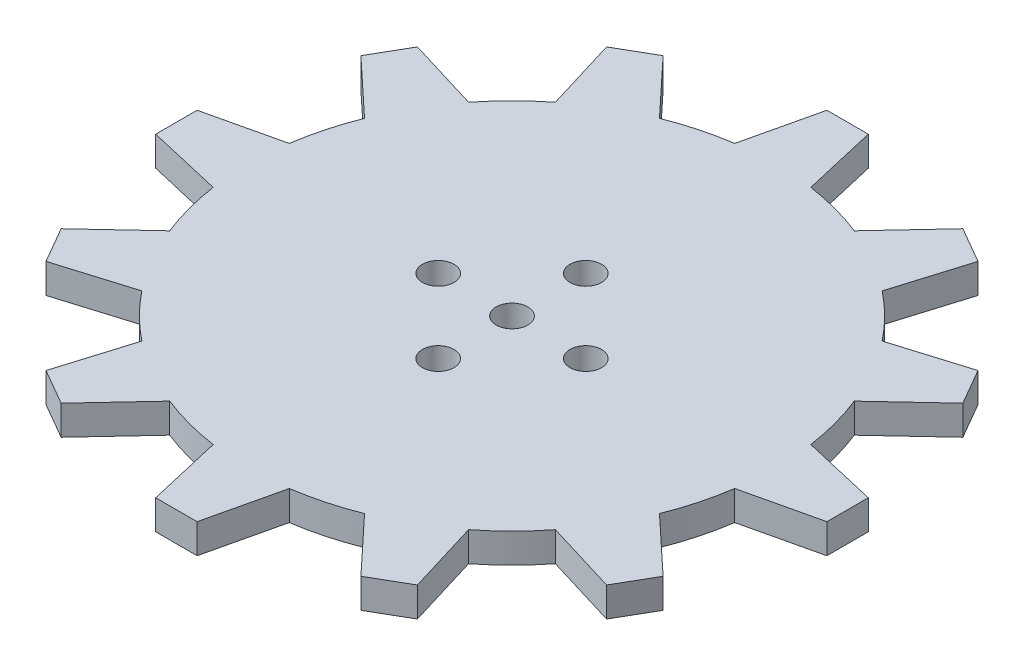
ISO-10303-21;
HEADER;
FILE_DESCRIPTION(('STEP AP214'),'2;1');
FILE_NAME('part.step','',(''),(''),'','','');
FILE_SCHEMA(('AUTOMOTIVE_DESIGN { 1 0 10303 214 1 1 1 1 }'));
ENDSEC;
DATA;
#1=APPLICATION_CONTEXT('core data for automotive mechanical design processes');
#2=APPLICATION_PROTOCOL_DEFINITION('international standard','automotive_design',2000,#1);
#3=PRODUCT_CONTEXT('',#1,'mechanical');
#4=PRODUCT('Part','Part','',(#3));
#5=PRODUCT_RELATED_PRODUCT_CATEGORY('part','',(#4));
#6=PRODUCT_DEFINITION_FORMATION('','',#4);
#7=PRODUCT_DEFINITION_CONTEXT('part definition',#1,'design');
#8=PRODUCT_DEFINITION('design','',#6,#7);
#9=PRODUCT_DEFINITION_SHAPE('','',#8);
#10=(LENGTH_UNIT() NAMED_UNIT(*) SI_UNIT(.MILLI.,.METRE.));
#11=(NAMED_UNIT(*) PLANE_ANGLE_UNIT() SI_UNIT($,.RADIAN.));
#12=(NAMED_UNIT(*) SI_UNIT($,.STERADIAN.) SOLID_ANGLE_UNIT());
#13=UNCERTAINTY_MEASURE_WITH_UNIT(LENGTH_MEASURE(1.E-05),#10,'distance_accuracy_value','');
#14=(GEOMETRIC_REPRESENTATION_CONTEXT(3) GLOBAL_UNCERTAINTY_ASSIGNED_CONTEXT((#13)) GLOBAL_UNIT_ASSIGNED_CONTEXT((#10,
#11,#12)) REPRESENTATION_CONTEXT('',''));
#15=CARTESIAN_POINT('',(0.,0.,0.));
#16=DIRECTION('',(0.,0.,1.));
#17=DIRECTION('',(1.,0.,0.));
#18=AXIS2_PLACEMENT_3D('',#15,#16,#17);
#19=CARTESIAN_POINT('',(0.,2.8,0.));
#20=DIRECTION('',(0.,-1.,0.));
#21=DIRECTION('',(0.,0.,-1.));
#22=AXIS2_PLACEMENT_3D('',#19,#20,#21);
#23=CYLINDRICAL_SURFACE('',#22,25.);
#24=CARTESIAN_POINT('',(0.,2.8,0.));
#25=DIRECTION('',(0.,1.,0.));
#26=DIRECTION('',(0.,0.,1.));
#27=AXIS2_PLACEMENT_3D('',#24,#25,#26);
#28=CIRCLE('',#27,25.);
#29=CARTESIAN_POINT('',(-23.2296720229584,2.8,-9.24025636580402));
#30=VERTEX_POINT('',#29);
#31=CARTESIAN_POINT('',(-24.7376142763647,2.8,-3.61253926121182));
#32=VERTEX_POINT('',#31);
#33=EDGE_CURVE('E44',#30,#32,#28,.T.);
#34=ORIENTED_EDGE('',*,*,#33,.F.);
#35=DIRECTION('',(0.,-1.,0.));
#36=VECTOR('',#35,1.);
#37=CARTESIAN_POINT('',(-23.2296720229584,2.8,-9.24025636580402));
#38=LINE('',#37,#36);
#39=CARTESIAN_POINT('',(-23.2296720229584,0.,-9.24025636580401));
#40=VERTEX_POINT('',#39);
#41=EDGE_CURVE('E375',#30,#40,#38,.T.);
#42=ORIENTED_EDGE('',*,*,#41,.T.);
#43=CARTESIAN_POINT('',(0.,0.,0.));
#44=DIRECTION('',(0.,1.,0.));
#45=DIRECTION('',(0.,0.,1.));
#46=AXIS2_PLACEMENT_3D('',#43,#44,#45);
#47=CIRCLE('',#46,25.);
#48=CARTESIAN_POINT('',(-24.7376142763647,0.,-3.61253926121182));
#49=VERTEX_POINT('',#48);
#50=EDGE_CURVE('E650',#40,#49,#47,.T.);
#51=ORIENTED_EDGE('',*,*,#50,.T.);
#52=DIRECTION('',(0.,-1.,0.));
#53=VECTOR('',#52,1.);
#54=CARTESIAN_POINT('',(-24.7376142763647,2.8,-3.61253926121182));
#55=LINE('',#54,#53);
#56=EDGE_CURVE('E643',#49,#32,#55,.F.);
#57=ORIENTED_EDGE('',*,*,#56,.T.);
#58=EDGE_LOOP('',(#34,#42,#51,#57));
#59=FACE_BOUND('',#58,.T.);
#60=ADVANCED_FACE('F33',(#59),#23,.T.);
#61=CARTESIAN_POINT('',(-15.4973579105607,0.,-19.6171327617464));
#62=VERTEX_POINT('',#61);
#63=CARTESIAN_POINT('',(-19.6171327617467,0.,-15.4973579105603));
#64=VERTEX_POINT('',#63);
#65=EDGE_CURVE('E738',#62,#64,#47,.T.);
#66=ORIENTED_EDGE('',*,*,#65,.T.);
#67=DIRECTION('',(0.,-1.,0.));
#68=VECTOR('',#67,1.);
#69=CARTESIAN_POINT('',(-19.6171327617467,2.8,-15.4973579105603));
#70=LINE('',#69,#68);
#71=CARTESIAN_POINT('',(-19.6171327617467,2.8,-15.4973579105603));
#72=VERTEX_POINT('',#71);
#73=EDGE_CURVE('E349',#64,#72,#70,.F.);
#74=ORIENTED_EDGE('',*,*,#73,.T.);
#75=CARTESIAN_POINT('',(-15.4973579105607,2.8,-19.6171327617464));
#76=VERTEX_POINT('',#75);
#77=EDGE_CURVE('E808',#76,#72,#28,.T.);
#78=ORIENTED_EDGE('',*,*,#77,.F.);
#79=DIRECTION('',(0.,-1.,0.));
#80=VECTOR('',#79,1.);
#81=CARTESIAN_POINT('',(-15.4973579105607,2.8,-19.6171327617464));
#82=LINE('',#81,#80);
#83=EDGE_CURVE('E398',#76,#62,#82,.T.);
#84=ORIENTED_EDGE('',*,*,#83,.T.);
#85=EDGE_LOOP('',(#66,#74,#78,#84));
#86=FACE_BOUND('',#85,.T.);
#87=ADVANCED_FACE('F687',(#86),#23,.T.);
#88=CARTESIAN_POINT('',(-3.61253926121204,0.,-24.7376142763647));
#89=VERTEX_POINT('',#88);
#90=CARTESIAN_POINT('',(-9.24025636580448,0.,-23.2296720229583));
#91=VERTEX_POINT('',#90);
#92=EDGE_CURVE('E739',#89,#91,#47,.T.);
#93=ORIENTED_EDGE('',*,*,#92,.T.);
#94=DIRECTION('',(0.,-1.,0.));
#95=VECTOR('',#94,1.);
#96=CARTESIAN_POINT('',(-9.24025636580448,2.8,-23.2296720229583));
#97=LINE('',#96,#95);
#98=CARTESIAN_POINT('',(-9.24025636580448,2.8,-23.2296720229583));
#99=VERTEX_POINT('',#98);
#100=EDGE_CURVE('E393',#91,#99,#97,.F.);
#101=ORIENTED_EDGE('',*,*,#100,.T.);
#102=CARTESIAN_POINT('',(-3.61253926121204,2.8,-24.7376142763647));
#103=VERTEX_POINT('',#102);
#104=EDGE_CURVE('E805',#103,#99,#28,.T.);
#105=ORIENTED_EDGE('',*,*,#104,.F.);
#106=DIRECTION('',(0.,-1.,0.));
#107=VECTOR('',#106,1.);
#108=CARTESIAN_POINT('',(-3.61253926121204,2.8,-24.7376142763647));
#109=LINE('',#108,#107);
#110=EDGE_CURVE('E423',#103,#89,#109,.T.);
#111=ORIENTED_EDGE('',*,*,#110,.T.);
#112=EDGE_LOOP('',(#93,#101,#105,#111));
#113=FACE_BOUND('',#112,.T.);
#114=ADVANCED_FACE('F693',(#113),#23,.T.);
#115=CARTESIAN_POINT('',(9.24025636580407,0.,-23.2296720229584));
#116=VERTEX_POINT('',#115);
#117=CARTESIAN_POINT('',(3.6125392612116,0.,-24.7376142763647));
#118=VERTEX_POINT('',#117);
#119=EDGE_CURVE('E741',#116,#118,#47,.T.);
#120=ORIENTED_EDGE('',*,*,#119,.T.);
#121=DIRECTION('',(0.,-1.,0.));
#122=VECTOR('',#121,1.);
#123=CARTESIAN_POINT('',(3.6125392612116,2.8,-24.7376142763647));
#124=LINE('',#123,#122);
#125=CARTESIAN_POINT('',(3.6125392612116,2.8,-24.7376142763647));
#126=VERTEX_POINT('',#125);
#127=EDGE_CURVE('E418',#118,#126,#124,.F.);
#128=ORIENTED_EDGE('',*,*,#127,.T.);
#129=CARTESIAN_POINT('',(9.24025636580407,2.8,-23.2296720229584));
#130=VERTEX_POINT('',#129);
#131=EDGE_CURVE('E802',#130,#126,#28,.T.);
#132=ORIENTED_EDGE('',*,*,#131,.F.);
#133=DIRECTION('',(0.,-1.,0.));
#134=VECTOR('',#133,1.);
#135=CARTESIAN_POINT('',(9.24025636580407,2.8,-23.2296720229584));
#136=LINE('',#135,#134);
#137=EDGE_CURVE('E448',#130,#116,#136,.T.);
#138=ORIENTED_EDGE('',*,*,#137,.T.);
#139=EDGE_LOOP('',(#120,#128,#132,#138));
#140=FACE_BOUND('',#139,.T.);
#141=ADVANCED_FACE('F928',(#140),#23,.T.);
#142=CARTESIAN_POINT('',(19.6171327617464,0.,-15.4973579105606));
#143=VERTEX_POINT('',#142);
#144=CARTESIAN_POINT('',(15.4973579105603,0.,-19.6171327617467));
#145=VERTEX_POINT('',#144);
#146=EDGE_CURVE('E745',#143,#145,#47,.T.);
#147=ORIENTED_EDGE('',*,*,#146,.T.);
#148=DIRECTION('',(0.,-1.,0.));
#149=VECTOR('',#148,1.);
#150=CARTESIAN_POINT('',(15.4973579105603,2.8,-19.6171327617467));
#151=LINE('',#150,#149);
#152=CARTESIAN_POINT('',(15.4973579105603,2.8,-19.6171327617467));
#153=VERTEX_POINT('',#152);
#154=EDGE_CURVE('E443',#145,#153,#151,.F.);
#155=ORIENTED_EDGE('',*,*,#154,.T.);
#156=CARTESIAN_POINT('',(19.6171327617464,2.8,-15.4973579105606));
#157=VERTEX_POINT('',#156);
#158=EDGE_CURVE('E799',#157,#153,#28,.T.);
#159=ORIENTED_EDGE('',*,*,#158,.F.);
#160=DIRECTION('',(0.,-1.,0.));
#161=VECTOR('',#160,1.);
#162=CARTESIAN_POINT('',(19.6171327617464,2.8,-15.4973579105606));
#163=LINE('',#162,#161);
#164=EDGE_CURVE('E473',#157,#143,#163,.T.);
#165=ORIENTED_EDGE('',*,*,#164,.T.);
#166=EDGE_LOOP('',(#147,#155,#159,#165));
#167=FACE_BOUND('',#166,.T.);
#168=ADVANCED_FACE('F924',(#167),#23,.T.);
#169=CARTESIAN_POINT('',(24.7376142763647,0.,-3.61253926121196));
#170=VERTEX_POINT('',#169);
#171=CARTESIAN_POINT('',(23.2296720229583,0.,-9.2402563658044));
#172=VERTEX_POINT('',#171);
#173=EDGE_CURVE('E749',#170,#172,#47,.T.);
#174=ORIENTED_EDGE('',*,*,#173,.T.);
#175=DIRECTION('',(0.,-1.,0.));
#176=VECTOR('',#175,1.);
#177=CARTESIAN_POINT('',(23.2296720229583,2.8,-9.2402563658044));
#178=LINE('',#177,#176);
#179=CARTESIAN_POINT('',(23.2296720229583,2.8,-9.2402563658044));
#180=VERTEX_POINT('',#179);
#181=EDGE_CURVE('E468',#172,#180,#178,.F.);
#182=ORIENTED_EDGE('',*,*,#181,.T.);
#183=CARTESIAN_POINT('',(24.7376142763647,2.8,-3.61253926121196));
#184=VERTEX_POINT('',#183);
#185=EDGE_CURVE('E796',#184,#180,#28,.T.);
#186=ORIENTED_EDGE('',*,*,#185,.F.);
#187=DIRECTION('',(0.,-1.,0.));
#188=VECTOR('',#187,1.);
#189=CARTESIAN_POINT('',(24.7376142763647,2.8,-3.61253926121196));
#190=LINE('',#189,#188);
#191=EDGE_CURVE('E498',#184,#170,#190,.T.);
#192=ORIENTED_EDGE('',*,*,#191,.T.);
#193=EDGE_LOOP('',(#174,#182,#186,#192));
#194=FACE_BOUND('',#193,.T.);
#195=ADVANCED_FACE('F920',(#194),#23,.T.);
#196=CARTESIAN_POINT('',(23.2296720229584,0.,9.24025636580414));
#197=VERTEX_POINT('',#196);
#198=CARTESIAN_POINT('',(24.7376142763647,0.,3.61253926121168));
#199=VERTEX_POINT('',#198);
#200=EDGE_CURVE('E753',#197,#199,#47,.T.);
#201=ORIENTED_EDGE('',*,*,#200,.T.);
#202=DIRECTION('',(0.,-1.,0.));
#203=VECTOR('',#202,1.);
#204=CARTESIAN_POINT('',(24.7376142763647,2.8,3.61253926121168));
#205=LINE('',#204,#203);
#206=CARTESIAN_POINT('',(24.7376142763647,2.8,3.61253926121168));
#207=VERTEX_POINT('',#206);
#208=EDGE_CURVE('E493',#199,#207,#205,.F.);
#209=ORIENTED_EDGE('',*,*,#208,.T.);
#210=CARTESIAN_POINT('',(23.2296720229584,2.8,9.24025636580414));
#211=VERTEX_POINT('',#210);
#212=EDGE_CURVE('E793',#211,#207,#28,.T.);
#213=ORIENTED_EDGE('',*,*,#212,.F.);
#214=DIRECTION('',(0.,-1.,0.));
#215=VECTOR('',#214,1.);
#216=CARTESIAN_POINT('',(23.2296720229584,2.8,9.24025636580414));
#217=LINE('',#216,#215);
#218=EDGE_CURVE('E523',#211,#197,#217,.T.);
#219=ORIENTED_EDGE('',*,*,#218,.T.);
#220=EDGE_LOOP('',(#201,#209,#213,#219));
#221=FACE_BOUND('',#220,.T.);
#222=ADVANCED_FACE('F916',(#221),#23,.T.);
#223=CARTESIAN_POINT('',(15.4973579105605,0.,19.6171327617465));
#224=VERTEX_POINT('',#223);
#225=CARTESIAN_POINT('',(19.6171327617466,0.,15.4973579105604));
#226=VERTEX_POINT('',#225);
#227=EDGE_CURVE('E757',#224,#226,#47,.T.);
#228=ORIENTED_EDGE('',*,*,#227,.T.);
#229=DIRECTION('',(0.,-1.,0.));
#230=VECTOR('',#229,1.);
#231=CARTESIAN_POINT('',(19.6171327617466,2.8,15.4973579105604));
#232=LINE('',#231,#230);
#233=CARTESIAN_POINT('',(19.6171327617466,2.8,15.4973579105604));
#234=VERTEX_POINT('',#233);
#235=EDGE_CURVE('E518',#226,#234,#232,.F.);
#236=ORIENTED_EDGE('',*,*,#235,.T.);
#237=CARTESIAN_POINT('',(15.4973579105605,2.8,19.6171327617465));
#238=VERTEX_POINT('',#237);
#239=EDGE_CURVE('E790',#238,#234,#28,.T.);
#240=ORIENTED_EDGE('',*,*,#239,.F.);
#241=DIRECTION('',(0.,-1.,0.));
#242=VECTOR('',#241,1.);
#243=CARTESIAN_POINT('',(15.4973579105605,2.8,19.6171327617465));
#244=LINE('',#243,#242);
#245=EDGE_CURVE('E548',#238,#224,#244,.T.);
#246=ORIENTED_EDGE('',*,*,#245,.T.);
#247=EDGE_LOOP('',(#228,#236,#240,#246));
#248=FACE_BOUND('',#247,.T.);
#249=ADVANCED_FACE('F912',(#248),#23,.T.);
#250=CARTESIAN_POINT('',(3.61253926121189,0.,24.7376142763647));
#251=VERTEX_POINT('',#250);
#252=CARTESIAN_POINT('',(9.24025636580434,0.,23.2296720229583));
#253=VERTEX_POINT('',#252);
#254=EDGE_CURVE('E761',#251,#253,#47,.T.);
#255=ORIENTED_EDGE('',*,*,#254,.T.);
#256=DIRECTION('',(0.,-1.,0.));
#257=VECTOR('',#256,1.);
#258=CARTESIAN_POINT('',(9.24025636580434,2.8,23.2296720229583));
#259=LINE('',#258,#257);
#260=CARTESIAN_POINT('',(9.24025636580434,2.8,23.2296720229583));
#261=VERTEX_POINT('',#260);
#262=EDGE_CURVE('E543',#253,#261,#259,.F.);
#263=ORIENTED_EDGE('',*,*,#262,.T.);
#264=CARTESIAN_POINT('',(3.61253926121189,2.8,24.7376142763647));
#265=VERTEX_POINT('',#264);
#266=EDGE_CURVE('E787',#265,#261,#28,.T.);
#267=ORIENTED_EDGE('',*,*,#266,.F.);
#268=DIRECTION('',(0.,-1.,0.));
#269=VECTOR('',#268,1.);
#270=CARTESIAN_POINT('',(3.61253926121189,2.8,24.7376142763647));
#271=LINE('',#270,#269);
#272=EDGE_CURVE('E573',#265,#251,#271,.T.);
#273=ORIENTED_EDGE('',*,*,#272,.T.);
#274=EDGE_LOOP('',(#255,#263,#267,#273));
#275=FACE_BOUND('',#274,.T.);
#276=ADVANCED_FACE('F908',(#275),#23,.T.);
#277=CARTESIAN_POINT('',(-9.24025636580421,0.,23.2296720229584));
#278=VERTEX_POINT('',#277);
#279=CARTESIAN_POINT('',(-3.61253926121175,0.,24.7376142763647));
#280=VERTEX_POINT('',#279);
#281=EDGE_CURVE('E765',#278,#280,#47,.T.);
#282=ORIENTED_EDGE('',*,*,#281,.T.);
#283=DIRECTION('',(0.,-1.,0.));
#284=VECTOR('',#283,1.);
#285=CARTESIAN_POINT('',(-3.61253926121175,2.8,24.7376142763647));
#286=LINE('',#285,#284);
#287=CARTESIAN_POINT('',(-3.61253926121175,2.8,24.7376142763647));
#288=VERTEX_POINT('',#287);
#289=EDGE_CURVE('E568',#280,#288,#286,.F.);
#290=ORIENTED_EDGE('',*,*,#289,.T.);
#291=CARTESIAN_POINT('',(-9.24025636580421,2.8,23.2296720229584));
#292=VERTEX_POINT('',#291);
#293=EDGE_CURVE('E786',#292,#288,#28,.T.);
#294=ORIENTED_EDGE('',*,*,#293,.F.);
#295=DIRECTION('',(0.,-1.,0.));
#296=VECTOR('',#295,1.);
#297=CARTESIAN_POINT('',(-9.24025636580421,2.8,23.2296720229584));
#298=LINE('',#297,#296);
#299=EDGE_CURVE('E598',#292,#278,#298,.T.);
#300=ORIENTED_EDGE('',*,*,#299,.T.);
#301=EDGE_LOOP('',(#282,#290,#294,#300));
#302=FACE_BOUND('',#301,.T.);
#303=ADVANCED_FACE('F707',(#302),#23,.T.);
#304=CARTESIAN_POINT('',(-19.6171327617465,0.,15.4973579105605));
#305=VERTEX_POINT('',#304);
#306=CARTESIAN_POINT('',(-15.4973579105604,0.,19.6171327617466));
#307=VERTEX_POINT('',#306);
#308=EDGE_CURVE('E655',#305,#307,#47,.T.);
#309=ORIENTED_EDGE('',*,*,#308,.T.);
#310=DIRECTION('',(0.,-1.,0.));
#311=VECTOR('',#310,1.);
#312=CARTESIAN_POINT('',(-15.4973579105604,2.8,19.6171327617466));
#313=LINE('',#312,#311);
#314=CARTESIAN_POINT('',(-15.4973579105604,2.8,19.6171327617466));
#315=VERTEX_POINT('',#314);
#316=EDGE_CURVE('E593',#307,#315,#313,.F.);
#317=ORIENTED_EDGE('',*,*,#316,.T.);
#318=CARTESIAN_POINT('',(-19.6171327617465,2.8,15.4973579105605));
#319=VERTEX_POINT('',#318);
#320=EDGE_CURVE('E42',#319,#315,#28,.T.);
#321=ORIENTED_EDGE('',*,*,#320,.F.);
#322=DIRECTION('',(0.,-1.,0.));
#323=VECTOR('',#322,1.);
#324=CARTESIAN_POINT('',(-19.6171327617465,2.8,15.4973579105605));
#325=LINE('',#324,#323);
#326=EDGE_CURVE('E623',#319,#305,#325,.T.);
#327=ORIENTED_EDGE('',*,*,#326,.T.);
#328=EDGE_LOOP('',(#309,#317,#321,#327));
#329=FACE_BOUND('',#328,.T.);
#330=ADVANCED_FACE('F698',(#329),#23,.T.);
#331=CARTESIAN_POINT('',(-24.7376142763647,0.,3.61253926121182));
#332=VERTEX_POINT('',#331);
#333=CARTESIAN_POINT('',(-23.2296720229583,0.,9.24025636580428));
#334=VERTEX_POINT('',#333);
#335=EDGE_CURVE('E652',#332,#334,#47,.T.);
#336=ORIENTED_EDGE('',*,*,#335,.T.);
#337=DIRECTION('',(0.,-1.,0.));
#338=VECTOR('',#337,1.);
#339=CARTESIAN_POINT('',(-23.2296720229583,2.8,9.24025636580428));
#340=LINE('',#339,#338);
#341=CARTESIAN_POINT('',(-23.2296720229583,2.8,9.24025636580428));
#342=VERTEX_POINT('',#341);
#343=EDGE_CURVE('E618',#334,#342,#340,.F.);
#344=ORIENTED_EDGE('',*,*,#343,.T.);
#345=CARTESIAN_POINT('',(-24.7376142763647,2.8,3.61253926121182));
#346=VERTEX_POINT('',#345);
#347=EDGE_CURVE('E11',#346,#342,#28,.T.);
#348=ORIENTED_EDGE('',*,*,#347,.F.);
#349=DIRECTION('',(0.,-1.,0.));
#350=VECTOR('',#349,1.);
#351=CARTESIAN_POINT('',(-24.7376142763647,2.8,3.61253926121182));
#352=LINE('',#351,#350);
#353=EDGE_CURVE('E648',#346,#332,#352,.T.);
#354=ORIENTED_EDGE('',*,*,#353,.T.);
#355=EDGE_LOOP('',(#336,#344,#348,#354));
#356=FACE_BOUND('',#355,.T.);
#357=ADVANCED_FACE('F35',(#356),#23,.T.);
#358=CARTESIAN_POINT('',(0.,2.8,0.));
#359=DIRECTION('',(0.,1.,0.));
#360=DIRECTION('',(0.,0.,1.));
#361=AXIS2_PLACEMENT_3D('',#358,#359,#360);
#362=PLANE('',#361);
#363=CARTESIAN_POINT('',(-7.,2.8,0.));
#364=DIRECTION('',(0.,1.,0.));
#365=DIRECTION('',(0.,0.,1.));
#366=AXIS2_PLACEMENT_3D('',#363,#364,#365);
#367=CIRCLE('',#366,1.5);
#368=CARTESIAN_POINT('',(-7.,2.8,1.5));
#369=VERTEX_POINT('',#368);
#370=EDGE_CURVE('E1427',#369,#369,#367,.T.);
#371=ORIENTED_EDGE('',*,*,#370,.F.);
#372=EDGE_LOOP('',(#371));
#373=FACE_BOUND('',#372,.T.);
#374=CARTESIAN_POINT('',(0.,2.8,-7.));
#375=DIRECTION('',(0.,1.,0.));
#376=DIRECTION('',(0.,0.,1.));
#377=AXIS2_PLACEMENT_3D('',#374,#375,#376);
#378=CIRCLE('',#377,1.5);
#379=CARTESIAN_POINT('',(0.,2.8,-5.5));
#380=VERTEX_POINT('',#379);
#381=EDGE_CURVE('E1423',#380,#380,#378,.T.);
#382=ORIENTED_EDGE('',*,*,#381,.F.);
#383=EDGE_LOOP('',(#382));
#384=FACE_BOUND('',#383,.T.);
#385=CARTESIAN_POINT('',(7.,2.8,0.));
#386=DIRECTION('',(0.,1.,0.));
#387=DIRECTION('',(0.,0.,1.));
#388=AXIS2_PLACEMENT_3D('',#385,#386,#387);
#389=CIRCLE('',#388,1.5);
#390=CARTESIAN_POINT('',(7.,2.8,1.5));
#391=VERTEX_POINT('',#390);
#392=EDGE_CURVE('E1413',#391,#391,#389,.T.);
#393=ORIENTED_EDGE('',*,*,#392,.F.);
#394=EDGE_LOOP('',(#393));
#395=FACE_BOUND('',#394,.T.);
#396=CARTESIAN_POINT('',(0.,2.8,7.));
#397=DIRECTION('',(0.,1.,0.));
#398=DIRECTION('',(0.,0.,1.));
#399=AXIS2_PLACEMENT_3D('',#396,#397,#398);
#400=CIRCLE('',#399,1.5);
#401=CARTESIAN_POINT('',(0.,2.8,8.5));
#402=VERTEX_POINT('',#401);
#403=EDGE_CURVE('E1424',#402,#402,#400,.T.);
#404=ORIENTED_EDGE('',*,*,#403,.F.);
#405=EDGE_LOOP('',(#404));
#406=FACE_BOUND('',#405,.T.);
#407=CARTESIAN_POINT('',(0.,2.8,0.));
#408=DIRECTION('',(0.,1.,0.));
#409=DIRECTION('',(0.,0.,1.));
#410=AXIS2_PLACEMENT_3D('',#407,#408,#409);
#411=CIRCLE('',#410,1.5);
#412=CARTESIAN_POINT('',(0.,2.8,1.5));
#413=VERTEX_POINT('',#412);
#414=EDGE_CURVE('E660',#413,#413,#411,.T.);
#415=ORIENTED_EDGE('',*,*,#414,.F.);
#416=EDGE_LOOP('',(#415));
#417=FACE_BOUND('',#416,.T.);
#418=ORIENTED_EDGE('',*,*,#77,.T.);
#419=DIRECTION('',(-0.956703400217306,0.,-0.29106460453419));
#420=VECTOR('',#419,1.);
#421=CARTESIAN_POINT('',(-17.9789802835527,2.8,-14.9989712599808));
#422=LINE('',#421,#420);
#423=CARTESIAN_POINT('',(-26.5893108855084,2.8,-17.6185527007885));
#424=VERTEX_POINT('',#423);
#425=EDGE_CURVE('E370',#72,#424,#422,.T.);
#426=ORIENTED_EDGE('',*,*,#425,.T.);
#427=DIRECTION('',(-0.499999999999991,0.,0.866025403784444));
#428=VECTOR('',#427,1.);
#429=CARTESIAN_POINT('',(-28.5527696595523,2.8,-14.2177423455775));
#430=LINE('',#429,#428);
#431=CARTESIAN_POINT('',(-28.5527696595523,2.8,-14.2177423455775));
#432=VERTEX_POINT('',#431);
#433=EDGE_CURVE('E360',#424,#432,#430,.T.);
#434=ORIENTED_EDGE('',*,*,#433,.T.);
#435=DIRECTION('',(0.730421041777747,0.,0.682997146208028));
#436=VECTOR('',#435,1.);
#437=CARTESIAN_POINT('',(-21.9789802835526,2.8,-8.07076802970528));
#438=LINE('',#437,#436);
#439=EDGE_CURVE('E51',#432,#30,#438,.T.);
#440=ORIENTED_EDGE('',*,*,#439,.T.);
#441=ORIENTED_EDGE('',*,*,#33,.T.);
#442=DIRECTION('',(-0.974061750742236,0.,0.226282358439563));
#443=VECTOR('',#442,1.);
#444=CARTESIAN_POINT('',(-23.0697392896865,2.8,-4.));
#445=LINE('',#444,#443);
#446=CARTESIAN_POINT('',(-31.8362950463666,2.8,-1.96345877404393));
#447=VERTEX_POINT('',#446);
#448=EDGE_CURVE('E637',#32,#447,#445,.T.);
#449=ORIENTED_EDGE('',*,*,#448,.T.);
#450=DIRECTION('',(0.,0.,1.));
#451=VECTOR('',#450,1.);
#452=CARTESIAN_POINT('',(-31.8362950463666,2.8,1.96345877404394));
#453=LINE('',#452,#451);
#454=CARTESIAN_POINT('',(-31.8362950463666,2.8,1.96345877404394));
#455=VERTEX_POINT('',#454);
#456=EDGE_CURVE('E630',#447,#455,#453,.T.);
#457=ORIENTED_EDGE('',*,*,#456,.T.);
#458=DIRECTION('',(0.974061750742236,0.,0.226282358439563));
#459=VECTOR('',#458,1.);
#460=CARTESIAN_POINT('',(-23.0697392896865,2.8,4.));
#461=LINE('',#460,#459);
#462=EDGE_CURVE('E626',#455,#346,#461,.T.);
#463=ORIENTED_EDGE('',*,*,#462,.T.);
#464=ORIENTED_EDGE('',*,*,#347,.T.);
#465=DIRECTION('',(-0.73042104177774,0.,0.682997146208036));
#466=VECTOR('',#465,1.);
#467=CARTESIAN_POINT('',(-21.9789802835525,2.8,8.07076802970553));
#468=LINE('',#467,#466);
#469=CARTESIAN_POINT('',(-28.5527696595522,2.8,14.2177423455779));
#470=VERTEX_POINT('',#469);
#471=EDGE_CURVE('E612',#342,#470,#468,.T.);
#472=ORIENTED_EDGE('',*,*,#471,.T.);
#473=DIRECTION('',(0.500000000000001,0.,0.866025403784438));
#474=VECTOR('',#473,1.);
#475=CARTESIAN_POINT('',(-26.5893108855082,2.8,17.6185527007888));
#476=LINE('',#475,#474);
#477=CARTESIAN_POINT('',(-26.5893108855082,2.8,17.6185527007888));
#478=VERTEX_POINT('',#477);
#479=EDGE_CURVE('E605',#470,#478,#476,.T.);
#480=ORIENTED_EDGE('',*,*,#479,.T.);
#481=DIRECTION('',(0.956703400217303,0.,-0.291064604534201));
#482=VECTOR('',#481,1.);
#483=CARTESIAN_POINT('',(-17.9789802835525,2.8,14.998971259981));
#484=LINE('',#483,#482);
#485=EDGE_CURVE('E601',#478,#319,#484,.T.);
#486=ORIENTED_EDGE('',*,*,#485,.T.);
#487=ORIENTED_EDGE('',*,*,#320,.T.);
#488=DIRECTION('',(-0.291064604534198,0.,0.956703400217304));
#489=VECTOR('',#488,1.);
#490=CARTESIAN_POINT('',(-14.998971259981,2.8,17.9789802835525));
#491=LINE('',#490,#489);
#492=CARTESIAN_POINT('',(-17.6185527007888,2.8,26.5893108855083));
#493=VERTEX_POINT('',#492);
#494=EDGE_CURVE('E587',#315,#493,#491,.T.);
#495=ORIENTED_EDGE('',*,*,#494,.T.);
#496=DIRECTION('',(0.86602540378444,0.,0.499999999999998));
#497=VECTOR('',#496,1.);
#498=CARTESIAN_POINT('',(-14.2177423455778,2.8,28.5527696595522));
#499=LINE('',#498,#497);
#500=CARTESIAN_POINT('',(-14.2177423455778,2.8,28.5527696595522));
#501=VERTEX_POINT('',#500);
#502=EDGE_CURVE('E580',#493,#501,#499,.T.);
#503=ORIENTED_EDGE('',*,*,#502,.T.);
#504=DIRECTION('',(0.682997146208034,0.,-0.730421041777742));
#505=VECTOR('',#504,1.);
#506=CARTESIAN_POINT('',(-8.07076802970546,2.8,21.9789802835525));
#507=LINE('',#506,#505);
#508=EDGE_CURVE('E576',#501,#292,#507,.T.);
#509=ORIENTED_EDGE('',*,*,#508,.T.);
#510=ORIENTED_EDGE('',*,*,#293,.T.);
#511=DIRECTION('',(0.226282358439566,0.,0.974061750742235));
#512=VECTOR('',#511,1.);
#513=CARTESIAN_POINT('',(-3.99999999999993,2.8,23.0697392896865));
#514=LINE('',#513,#512);
#515=CARTESIAN_POINT('',(-1.96345877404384,2.8,31.8362950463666));
#516=VERTEX_POINT('',#515);
#517=EDGE_CURVE('E562',#288,#516,#514,.T.);
#518=ORIENTED_EDGE('',*,*,#517,.T.);
#519=DIRECTION('',(1.,0.,0.));
#520=VECTOR('',#519,1.);
#521=CARTESIAN_POINT('',(1.96345877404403,2.8,31.8362950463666));
#522=LINE('',#521,#520);
#523=CARTESIAN_POINT('',(1.96345877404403,2.8,31.8362950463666));
#524=VERTEX_POINT('',#523);
#525=EDGE_CURVE('E555',#516,#524,#522,.T.);
#526=ORIENTED_EDGE('',*,*,#525,.T.);
#527=DIRECTION('',(0.22628235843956,0.,-0.974061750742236));
#528=VECTOR('',#527,1.);
#529=CARTESIAN_POINT('',(4.00000000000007,2.8,23.0697392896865));
#530=LINE('',#529,#528);
#531=EDGE_CURVE('E551',#524,#265,#530,.T.);
#532=ORIENTED_EDGE('',*,*,#531,.T.);
#533=ORIENTED_EDGE('',*,*,#266,.T.);
#534=DIRECTION('',(0.682997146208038,0.,0.730421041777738));
#535=VECTOR('',#534,1.);
#536=CARTESIAN_POINT('',(8.07076802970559,2.8,21.9789802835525));
#537=LINE('',#536,#535);
#538=CARTESIAN_POINT('',(14.2177423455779,2.8,28.5527696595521));
#539=VERTEX_POINT('',#538);
#540=EDGE_CURVE('E537',#261,#539,#537,.T.);
#541=ORIENTED_EDGE('',*,*,#540,.T.);
#542=DIRECTION('',(0.866025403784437,0.,-0.500000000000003));
#543=VECTOR('',#542,1.);
#544=CARTESIAN_POINT('',(17.6185527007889,2.8,26.5893108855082));
#545=LINE('',#544,#543);
#546=CARTESIAN_POINT('',(17.6185527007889,2.8,26.5893108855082));
#547=VERTEX_POINT('',#546);
#548=EDGE_CURVE('E530',#539,#547,#545,.T.);
#549=ORIENTED_EDGE('',*,*,#548,.T.);
#550=DIRECTION('',(-0.291064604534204,0.,-0.956703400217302));
#551=VECTOR('',#550,1.);
#552=CARTESIAN_POINT('',(14.9989712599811,2.8,17.9789802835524));
#553=LINE('',#552,#551);
#554=EDGE_CURVE('E526',#547,#238,#553,.T.);
#555=ORIENTED_EDGE('',*,*,#554,.T.);
#556=ORIENTED_EDGE('',*,*,#239,.T.);
#557=DIRECTION('',(0.956703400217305,0.,0.291064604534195));
#558=VECTOR('',#557,1.);
#559=CARTESIAN_POINT('',(17.9789802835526,2.8,14.9989712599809));
#560=LINE('',#559,#558);
#561=CARTESIAN_POINT('',(26.5893108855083,2.8,17.6185527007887));
#562=VERTEX_POINT('',#561);
#563=EDGE_CURVE('E512',#234,#562,#560,.T.);
#564=ORIENTED_EDGE('',*,*,#563,.T.);
#565=DIRECTION('',(0.499999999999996,0.,-0.866025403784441));
#566=VECTOR('',#565,1.);
#567=CARTESIAN_POINT('',(28.5527696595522,2.8,14.2177423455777));
#568=LINE('',#567,#566);
#569=CARTESIAN_POINT('',(28.5527696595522,2.8,14.2177423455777));
#570=VERTEX_POINT('',#569);
#571=EDGE_CURVE('E505',#562,#570,#568,.T.);
#572=ORIENTED_EDGE('',*,*,#571,.T.);
#573=DIRECTION('',(-0.730421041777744,0.,-0.682997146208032));
#574=VECTOR('',#573,1.);
#575=CARTESIAN_POINT('',(21.9789802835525,2.8,8.07076802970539));
#576=LINE('',#575,#574);
#577=EDGE_CURVE('E501',#570,#211,#576,.T.);
#578=ORIENTED_EDGE('',*,*,#577,.T.);
#579=ORIENTED_EDGE('',*,*,#212,.T.);
#580=DIRECTION('',(0.974061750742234,0.,-0.226282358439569));
#581=VECTOR('',#580,1.);
#582=CARTESIAN_POINT('',(23.0697392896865,2.8,3.99999999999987));
#583=LINE('',#582,#581);
#584=CARTESIAN_POINT('',(31.8362950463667,2.8,1.96345877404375));
#585=VERTEX_POINT('',#584);
#586=EDGE_CURVE('E487',#207,#585,#583,.T.);
#587=ORIENTED_EDGE('',*,*,#586,.T.);
#588=DIRECTION('',(0.,0.,-1.));
#589=VECTOR('',#588,1.);
#590=CARTESIAN_POINT('',(31.8362950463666,2.8,-1.96345877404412));
#591=LINE('',#590,#589);
#592=CARTESIAN_POINT('',(31.8362950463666,2.8,-1.96345877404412));
#593=VERTEX_POINT('',#592);
#594=EDGE_CURVE('E480',#585,#593,#591,.T.);
#595=ORIENTED_EDGE('',*,*,#594,.T.);
#596=DIRECTION('',(-0.974061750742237,0.,-0.226282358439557));
#597=VECTOR('',#596,1.);
#598=CARTESIAN_POINT('',(23.0697392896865,2.8,-4.00000000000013));
#599=LINE('',#598,#597);
#600=EDGE_CURVE('E476',#593,#184,#599,.T.);
#601=ORIENTED_EDGE('',*,*,#600,.T.);
#602=ORIENTED_EDGE('',*,*,#185,.T.);
#603=DIRECTION('',(0.730421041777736,0.,-0.68299714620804));
#604=VECTOR('',#603,1.);
#605=CARTESIAN_POINT('',(21.9789802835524,2.8,-8.07076802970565));
#606=LINE('',#605,#604);
#607=CARTESIAN_POINT('',(28.5527696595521,2.8,-14.217742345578));
#608=VERTEX_POINT('',#607);
#609=EDGE_CURVE('E462',#180,#608,#606,.T.);
#610=ORIENTED_EDGE('',*,*,#609,.T.);
#611=DIRECTION('',(-0.500000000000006,0.,-0.866025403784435));
#612=VECTOR('',#611,1.);
#613=CARTESIAN_POINT('',(26.5893108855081,2.8,-17.618552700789));
#614=LINE('',#613,#612);
#615=CARTESIAN_POINT('',(26.5893108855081,2.8,-17.618552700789));
#616=VERTEX_POINT('',#615);
#617=EDGE_CURVE('E455',#608,#616,#614,.T.);
#618=ORIENTED_EDGE('',*,*,#617,.T.);
#619=DIRECTION('',(-0.956703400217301,0.,0.291064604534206));
#620=VECTOR('',#619,1.);
#621=CARTESIAN_POINT('',(17.9789802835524,2.8,-14.9989712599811));
#622=LINE('',#621,#620);
#623=EDGE_CURVE('E451',#616,#157,#622,.T.);
#624=ORIENTED_EDGE('',*,*,#623,.T.);
#625=ORIENTED_EDGE('',*,*,#158,.T.);
#626=DIRECTION('',(0.291064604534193,0.,-0.956703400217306));
#627=VECTOR('',#626,1.);
#628=CARTESIAN_POINT('',(14.9989712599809,2.8,-17.9789802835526));
#629=LINE('',#628,#627);
#630=CARTESIAN_POINT('',(17.6185527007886,2.8,-26.5893108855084));
#631=VERTEX_POINT('',#630);
#632=EDGE_CURVE('E437',#153,#631,#629,.T.);
#633=ORIENTED_EDGE('',*,*,#632,.T.);
#634=DIRECTION('',(-0.866025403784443,0.,-0.499999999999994));
#635=VECTOR('',#634,1.);
#636=CARTESIAN_POINT('',(14.2177423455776,2.8,-28.5527696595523));
#637=LINE('',#636,#635);
#638=CARTESIAN_POINT('',(14.2177423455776,2.8,-28.5527696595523));
#639=VERTEX_POINT('',#638);
#640=EDGE_CURVE('E430',#631,#639,#637,.T.);
#641=ORIENTED_EDGE('',*,*,#640,.T.);
#642=DIRECTION('',(-0.68299714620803,0.,0.730421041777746));
#643=VECTOR('',#642,1.);
#644=CARTESIAN_POINT('',(8.07076802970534,2.8,-21.9789802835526));
#645=LINE('',#644,#643);
#646=EDGE_CURVE('E426',#639,#130,#645,.T.);
#647=ORIENTED_EDGE('',*,*,#646,.T.);
#648=ORIENTED_EDGE('',*,*,#131,.T.);
#649=DIRECTION('',(-0.226282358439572,0.,-0.974061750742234));
#650=VECTOR('',#649,1.);
#651=CARTESIAN_POINT('',(3.9999999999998,2.8,-23.0697392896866));
#652=LINE('',#651,#650);
#653=CARTESIAN_POINT('',(1.96345877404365,2.8,-31.8362950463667));
#654=VERTEX_POINT('',#653);
#655=EDGE_CURVE('E412',#126,#654,#652,.T.);
#656=ORIENTED_EDGE('',*,*,#655,.T.);
#657=DIRECTION('',(-1.,0.,0.));
#658=VECTOR('',#657,1.);
#659=CARTESIAN_POINT('',(-1.96345877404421,2.8,-31.8362950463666));
#660=LINE('',#659,#658);
#661=CARTESIAN_POINT('',(-1.96345877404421,2.8,-31.8362950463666));
#662=VERTEX_POINT('',#661);
#663=EDGE_CURVE('E405',#654,#662,#660,.T.);
#664=ORIENTED_EDGE('',*,*,#663,.T.);
#665=DIRECTION('',(-0.226282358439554,0.,0.974061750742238));
#666=VECTOR('',#665,1.);
#667=CARTESIAN_POINT('',(-4.0000000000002,2.8,-23.0697392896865));
#668=LINE('',#667,#666);
#669=EDGE_CURVE('E401',#662,#103,#668,.T.);
#670=ORIENTED_EDGE('',*,*,#669,.T.);
#671=ORIENTED_EDGE('',*,*,#104,.T.);
#672=DIRECTION('',(-0.682997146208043,0.,-0.730421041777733));
#673=VECTOR('',#672,1.);
#674=CARTESIAN_POINT('',(-8.07076802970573,2.8,-21.9789802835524));
#675=LINE('',#674,#673);
#676=CARTESIAN_POINT('',(-14.2177423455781,2.8,-28.552769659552));
#677=VERTEX_POINT('',#676);
#678=EDGE_CURVE('E388',#99,#677,#675,.T.);
#679=ORIENTED_EDGE('',*,*,#678,.T.);
#680=DIRECTION('',(-0.866025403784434,0.,0.500000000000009));
#681=VECTOR('',#680,1.);
#682=CARTESIAN_POINT('',(-17.6185527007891,2.8,-26.5893108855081));
#683=LINE('',#682,#681);
#684=CARTESIAN_POINT('',(-17.6185527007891,2.8,-26.5893108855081));
#685=VERTEX_POINT('',#684);
#686=EDGE_CURVE('E381',#677,#685,#683,.T.);
#687=ORIENTED_EDGE('',*,*,#686,.T.);
#688=DIRECTION('',(0.29106460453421,0.,0.9567034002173));
#689=VECTOR('',#688,1.);
#690=CARTESIAN_POINT('',(-14.9989712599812,2.8,-17.9789802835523));
#691=LINE('',#690,#689);
#692=EDGE_CURVE('E58',#685,#76,#691,.T.);
#693=ORIENTED_EDGE('',*,*,#692,.T.);
#694=EDGE_LOOP('',(#418,#426,#434,#440,#441,#449,#457,#463,#464,#472,#480,#486,#487,#495,#503,
#509,#510,#518,#526,#532,#533,#541,#549,#555,#556,#564,#572,#578,#579,#587,#595,#601,#602,#610,
#618,#624,#625,#633,#641,#647,#648,#656,#664,#670,#671,#679,#687,#693));
#695=FACE_BOUND('',#694,.T.);
#696=ADVANCED_FACE('F697',(#373,#384,#395,#406,#417,#695),#362,.T.);
#697=CARTESIAN_POINT('',(0.,0.,0.));
#698=DIRECTION('',(0.,1.,0.));
#699=DIRECTION('',(0.,0.,1.));
#700=AXIS2_PLACEMENT_3D('',#697,#698,#699);
#701=PLANE('',#700);
#702=CARTESIAN_POINT('',(-7.,0.,0.));
#703=DIRECTION('',(0.,1.,0.));
#704=DIRECTION('',(0.,0.,1.));
#705=AXIS2_PLACEMENT_3D('',#702,#703,#704);
#706=CIRCLE('',#705,1.5);
#707=CARTESIAN_POINT('',(-7.,0.,1.5));
#708=VERTEX_POINT('',#707);
#709=EDGE_CURVE('E37',#708,#708,#706,.T.);
#710=ORIENTED_EDGE('',*,*,#709,.T.);
#711=EDGE_LOOP('',(#710));
#712=FACE_BOUND('',#711,.T.);
#713=CARTESIAN_POINT('',(0.,0.,-7.));
#714=DIRECTION('',(0.,1.,0.));
#715=DIRECTION('',(0.,0.,1.));
#716=AXIS2_PLACEMENT_3D('',#713,#714,#715);
#717=CIRCLE('',#716,1.5);
#718=CARTESIAN_POINT('',(0.,0.,-5.5));
#719=VERTEX_POINT('',#718);
#720=EDGE_CURVE('E665',#719,#719,#717,.T.);
#721=ORIENTED_EDGE('',*,*,#720,.T.);
#722=EDGE_LOOP('',(#721));
#723=FACE_BOUND('',#722,.T.);
#724=CARTESIAN_POINT('',(7.,0.,0.));
#725=DIRECTION('',(0.,1.,0.));
#726=DIRECTION('',(0.,0.,1.));
#727=AXIS2_PLACEMENT_3D('',#724,#725,#726);
#728=CIRCLE('',#727,1.5);
#729=CARTESIAN_POINT('',(7.,0.,1.5));
#730=VERTEX_POINT('',#729);
#731=EDGE_CURVE('E663',#730,#730,#728,.T.);
#732=ORIENTED_EDGE('',*,*,#731,.T.);
#733=EDGE_LOOP('',(#732));
#734=FACE_BOUND('',#733,.T.);
#735=CARTESIAN_POINT('',(0.,0.,7.));
#736=DIRECTION('',(0.,1.,0.));
#737=DIRECTION('',(0.,0.,1.));
#738=AXIS2_PLACEMENT_3D('',#735,#736,#737);
#739=CIRCLE('',#738,1.5);
#740=CARTESIAN_POINT('',(0.,0.,8.5));
#741=VERTEX_POINT('',#740);
#742=EDGE_CURVE('E659',#741,#741,#739,.T.);
#743=ORIENTED_EDGE('',*,*,#742,.T.);
#744=EDGE_LOOP('',(#743));
#745=FACE_BOUND('',#744,.T.);
#746=CARTESIAN_POINT('',(0.,0.,0.));
#747=DIRECTION('',(0.,1.,0.));
#748=DIRECTION('',(0.,0.,1.));
#749=AXIS2_PLACEMENT_3D('',#746,#747,#748);
#750=CIRCLE('',#749,1.5);
#751=CARTESIAN_POINT('',(0.,0.,1.5));
#752=VERTEX_POINT('',#751);
#753=EDGE_CURVE('E656',#752,#752,#750,.T.);
#754=ORIENTED_EDGE('',*,*,#753,.T.);
#755=EDGE_LOOP('',(#754));
#756=FACE_BOUND('',#755,.T.);
#757=ORIENTED_EDGE('',*,*,#50,.F.);
#758=DIRECTION('',(0.730421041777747,0.,0.682997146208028));
#759=VECTOR('',#758,1.);
#760=CARTESIAN_POINT('',(-21.9789802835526,0.,-8.07076802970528));
#761=LINE('',#760,#759);
#762=CARTESIAN_POINT('',(-28.5527696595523,0.,-14.2177423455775));
#763=VERTEX_POINT('',#762);
#764=EDGE_CURVE('E355',#763,#40,#761,.T.);
#765=ORIENTED_EDGE('',*,*,#764,.F.);
#766=DIRECTION('',(-0.499999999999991,0.,0.866025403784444));
#767=VECTOR('',#766,1.);
#768=CARTESIAN_POINT('',(-28.5527696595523,0.,-14.2177423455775));
#769=LINE('',#768,#767);
#770=CARTESIAN_POINT('',(-26.5893108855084,0.,-17.6185527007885));
#771=VERTEX_POINT('',#770);
#772=EDGE_CURVE('E354',#771,#763,#769,.T.);
#773=ORIENTED_EDGE('',*,*,#772,.F.);
#774=DIRECTION('',(-0.956703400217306,0.,-0.29106460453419));
#775=VECTOR('',#774,1.);
#776=CARTESIAN_POINT('',(-17.9789802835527,0.,-14.9989712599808));
#777=LINE('',#776,#775);
#778=EDGE_CURVE('E343',#64,#771,#777,.T.);
#779=ORIENTED_EDGE('',*,*,#778,.F.);
#780=ORIENTED_EDGE('',*,*,#65,.F.);
#781=DIRECTION('',(0.29106460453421,0.,0.9567034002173));
#782=VECTOR('',#781,1.);
#783=CARTESIAN_POINT('',(-14.9989712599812,0.,-17.9789802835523));
#784=LINE('',#783,#782);
#785=CARTESIAN_POINT('',(-17.6185527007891,0.,-26.5893108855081));
#786=VERTEX_POINT('',#785);
#787=EDGE_CURVE('E378',#786,#62,#784,.T.);
#788=ORIENTED_EDGE('',*,*,#787,.F.);
#789=DIRECTION('',(-0.866025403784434,0.,0.500000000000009));
#790=VECTOR('',#789,1.);
#791=CARTESIAN_POINT('',(-17.6185527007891,0.,-26.5893108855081));
#792=LINE('',#791,#790);
#793=CARTESIAN_POINT('',(-14.2177423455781,0.,-28.552769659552));
#794=VERTEX_POINT('',#793);
#795=EDGE_CURVE('E383',#794,#786,#792,.T.);
#796=ORIENTED_EDGE('',*,*,#795,.F.);
#797=DIRECTION('',(-0.682997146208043,0.,-0.730421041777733));
#798=VECTOR('',#797,1.);
#799=CARTESIAN_POINT('',(-8.07076802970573,0.,-21.9789802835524));
#800=LINE('',#799,#798);
#801=EDGE_CURVE('E380',#91,#794,#800,.T.);
#802=ORIENTED_EDGE('',*,*,#801,.F.);
#803=ORIENTED_EDGE('',*,*,#92,.F.);
#804=DIRECTION('',(-0.226282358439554,0.,0.974061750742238));
#805=VECTOR('',#804,1.);
#806=CARTESIAN_POINT('',(-4.0000000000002,0.,-23.0697392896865));
#807=LINE('',#806,#805);
#808=CARTESIAN_POINT('',(-1.96345877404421,0.,-31.8362950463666));
#809=VERTEX_POINT('',#808);
#810=EDGE_CURVE('E402',#809,#89,#807,.T.);
#811=ORIENTED_EDGE('',*,*,#810,.F.);
#812=DIRECTION('',(-1.,0.,0.));
#813=VECTOR('',#812,1.);
#814=CARTESIAN_POINT('',(-1.96345877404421,0.,-31.8362950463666));
#815=LINE('',#814,#813);
#816=CARTESIAN_POINT('',(1.96345877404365,0.,-31.8362950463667));
#817=VERTEX_POINT('',#816);
#818=EDGE_CURVE('E407',#817,#809,#815,.T.);
#819=ORIENTED_EDGE('',*,*,#818,.F.);
#820=DIRECTION('',(-0.226282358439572,0.,-0.974061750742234));
#821=VECTOR('',#820,1.);
#822=CARTESIAN_POINT('',(3.9999999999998,0.,-23.0697392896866));
#823=LINE('',#822,#821);
#824=EDGE_CURVE('E404',#118,#817,#823,.T.);
#825=ORIENTED_EDGE('',*,*,#824,.F.);
#826=ORIENTED_EDGE('',*,*,#119,.F.);
#827=DIRECTION('',(-0.68299714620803,0.,0.730421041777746));
#828=VECTOR('',#827,1.);
#829=CARTESIAN_POINT('',(8.07076802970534,0.,-21.9789802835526));
#830=LINE('',#829,#828);
#831=CARTESIAN_POINT('',(14.2177423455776,0.,-28.5527696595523));
#832=VERTEX_POINT('',#831);
#833=EDGE_CURVE('E427',#832,#116,#830,.T.);
#834=ORIENTED_EDGE('',*,*,#833,.F.);
#835=DIRECTION('',(-0.866025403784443,0.,-0.499999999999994));
#836=VECTOR('',#835,1.);
#837=CARTESIAN_POINT('',(14.2177423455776,0.,-28.5527696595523));
#838=LINE('',#837,#836);
#839=CARTESIAN_POINT('',(17.6185527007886,0.,-26.5893108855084));
#840=VERTEX_POINT('',#839);
#841=EDGE_CURVE('E432',#840,#832,#838,.T.);
#842=ORIENTED_EDGE('',*,*,#841,.F.);
#843=DIRECTION('',(0.291064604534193,0.,-0.956703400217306));
#844=VECTOR('',#843,1.);
#845=CARTESIAN_POINT('',(14.9989712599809,0.,-17.9789802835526));
#846=LINE('',#845,#844);
#847=EDGE_CURVE('E429',#145,#840,#846,.T.);
#848=ORIENTED_EDGE('',*,*,#847,.F.);
#849=ORIENTED_EDGE('',*,*,#146,.F.);
#850=DIRECTION('',(-0.956703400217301,0.,0.291064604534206));
#851=VECTOR('',#850,1.);
#852=CARTESIAN_POINT('',(17.9789802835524,0.,-14.9989712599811));
#853=LINE('',#852,#851);
#854=CARTESIAN_POINT('',(26.5893108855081,0.,-17.618552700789));
#855=VERTEX_POINT('',#854);
#856=EDGE_CURVE('E452',#855,#143,#853,.T.);
#857=ORIENTED_EDGE('',*,*,#856,.F.);
#858=DIRECTION('',(-0.500000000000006,0.,-0.866025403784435));
#859=VECTOR('',#858,1.);
#860=CARTESIAN_POINT('',(26.5893108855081,0.,-17.618552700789));
#861=LINE('',#860,#859);
#862=CARTESIAN_POINT('',(28.5527696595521,0.,-14.217742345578));
#863=VERTEX_POINT('',#862);
#864=EDGE_CURVE('E457',#863,#855,#861,.T.);
#865=ORIENTED_EDGE('',*,*,#864,.F.);
#866=DIRECTION('',(0.730421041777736,0.,-0.68299714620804));
#867=VECTOR('',#866,1.);
#868=CARTESIAN_POINT('',(21.9789802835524,0.,-8.07076802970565));
#869=LINE('',#868,#867);
#870=EDGE_CURVE('E454',#172,#863,#869,.T.);
#871=ORIENTED_EDGE('',*,*,#870,.F.);
#872=ORIENTED_EDGE('',*,*,#173,.F.);
#873=DIRECTION('',(-0.974061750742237,0.,-0.226282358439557));
#874=VECTOR('',#873,1.);
#875=CARTESIAN_POINT('',(23.0697392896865,0.,-4.00000000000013));
#876=LINE('',#875,#874);
#877=CARTESIAN_POINT('',(31.8362950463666,0.,-1.96345877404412));
#878=VERTEX_POINT('',#877);
#879=EDGE_CURVE('E477',#878,#170,#876,.T.);
#880=ORIENTED_EDGE('',*,*,#879,.F.);
#881=DIRECTION('',(0.,0.,-1.));
#882=VECTOR('',#881,1.);
#883=CARTESIAN_POINT('',(31.8362950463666,0.,-1.96345877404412));
#884=LINE('',#883,#882);
#885=CARTESIAN_POINT('',(31.8362950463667,0.,1.96345877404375));
#886=VERTEX_POINT('',#885);
#887=EDGE_CURVE('E482',#886,#878,#884,.T.);
#888=ORIENTED_EDGE('',*,*,#887,.F.);
#889=DIRECTION('',(0.974061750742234,0.,-0.226282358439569));
#890=VECTOR('',#889,1.);
#891=CARTESIAN_POINT('',(23.0697392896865,0.,3.99999999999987));
#892=LINE('',#891,#890);
#893=EDGE_CURVE('E479',#199,#886,#892,.T.);
#894=ORIENTED_EDGE('',*,*,#893,.F.);
#895=ORIENTED_EDGE('',*,*,#200,.F.);
#896=DIRECTION('',(-0.730421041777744,0.,-0.682997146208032));
#897=VECTOR('',#896,1.);
#898=CARTESIAN_POINT('',(21.9789802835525,0.,8.07076802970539));
#899=LINE('',#898,#897);
#900=CARTESIAN_POINT('',(28.5527696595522,0.,14.2177423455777));
#901=VERTEX_POINT('',#900);
#902=EDGE_CURVE('E502',#901,#197,#899,.T.);
#903=ORIENTED_EDGE('',*,*,#902,.F.);
#904=DIRECTION('',(0.499999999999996,0.,-0.866025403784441));
#905=VECTOR('',#904,1.);
#906=CARTESIAN_POINT('',(28.5527696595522,0.,14.2177423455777));
#907=LINE('',#906,#905);
#908=CARTESIAN_POINT('',(26.5893108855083,0.,17.6185527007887));
#909=VERTEX_POINT('',#908);
#910=EDGE_CURVE('E507',#909,#901,#907,.T.);
#911=ORIENTED_EDGE('',*,*,#910,.F.);
#912=DIRECTION('',(0.956703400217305,0.,0.291064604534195));
#913=VECTOR('',#912,1.);
#914=CARTESIAN_POINT('',(17.9789802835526,0.,14.9989712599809));
#915=LINE('',#914,#913);
#916=EDGE_CURVE('E504',#226,#909,#915,.T.);
#917=ORIENTED_EDGE('',*,*,#916,.F.);
#918=ORIENTED_EDGE('',*,*,#227,.F.);
#919=DIRECTION('',(-0.291064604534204,0.,-0.956703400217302));
#920=VECTOR('',#919,1.);
#921=CARTESIAN_POINT('',(14.9989712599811,0.,17.9789802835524));
#922=LINE('',#921,#920);
#923=CARTESIAN_POINT('',(17.6185527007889,0.,26.5893108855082));
#924=VERTEX_POINT('',#923);
#925=EDGE_CURVE('E527',#924,#224,#922,.T.);
#926=ORIENTED_EDGE('',*,*,#925,.F.);
#927=DIRECTION('',(0.866025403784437,0.,-0.500000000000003));
#928=VECTOR('',#927,1.);
#929=CARTESIAN_POINT('',(17.6185527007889,0.,26.5893108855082));
#930=LINE('',#929,#928);
#931=CARTESIAN_POINT('',(14.2177423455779,0.,28.5527696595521));
#932=VERTEX_POINT('',#931);
#933=EDGE_CURVE('E532',#932,#924,#930,.T.);
#934=ORIENTED_EDGE('',*,*,#933,.F.);
#935=DIRECTION('',(0.682997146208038,0.,0.730421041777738));
#936=VECTOR('',#935,1.);
#937=CARTESIAN_POINT('',(8.07076802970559,0.,21.9789802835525));
#938=LINE('',#937,#936);
#939=EDGE_CURVE('E529',#253,#932,#938,.T.);
#940=ORIENTED_EDGE('',*,*,#939,.F.);
#941=ORIENTED_EDGE('',*,*,#254,.F.);
#942=DIRECTION('',(0.22628235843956,0.,-0.974061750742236));
#943=VECTOR('',#942,1.);
#944=CARTESIAN_POINT('',(4.00000000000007,0.,23.0697392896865));
#945=LINE('',#944,#943);
#946=CARTESIAN_POINT('',(1.96345877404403,0.,31.8362950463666));
#947=VERTEX_POINT('',#946);
#948=EDGE_CURVE('E552',#947,#251,#945,.T.);
#949=ORIENTED_EDGE('',*,*,#948,.F.);
#950=DIRECTION('',(1.,0.,0.));
#951=VECTOR('',#950,1.);
#952=CARTESIAN_POINT('',(1.96345877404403,0.,31.8362950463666));
#953=LINE('',#952,#951);
#954=CARTESIAN_POINT('',(-1.96345877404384,0.,31.8362950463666));
#955=VERTEX_POINT('',#954);
#956=EDGE_CURVE('E557',#955,#947,#953,.T.);
#957=ORIENTED_EDGE('',*,*,#956,.F.);
#958=DIRECTION('',(0.226282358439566,0.,0.974061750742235));
#959=VECTOR('',#958,1.);
#960=CARTESIAN_POINT('',(-3.99999999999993,0.,23.0697392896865));
#961=LINE('',#960,#959);
#962=EDGE_CURVE('E554',#280,#955,#961,.T.);
#963=ORIENTED_EDGE('',*,*,#962,.F.);
#964=ORIENTED_EDGE('',*,*,#281,.F.);
#965=DIRECTION('',(0.682997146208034,0.,-0.730421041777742));
#966=VECTOR('',#965,1.);
#967=CARTESIAN_POINT('',(-8.07076802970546,0.,21.9789802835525));
#968=LINE('',#967,#966);
#969=CARTESIAN_POINT('',(-14.2177423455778,0.,28.5527696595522));
#970=VERTEX_POINT('',#969);
#971=EDGE_CURVE('E577',#970,#278,#968,.T.);
#972=ORIENTED_EDGE('',*,*,#971,.F.);
#973=DIRECTION('',(0.86602540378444,0.,0.499999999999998));
#974=VECTOR('',#973,1.);
#975=CARTESIAN_POINT('',(-14.2177423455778,0.,28.5527696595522));
#976=LINE('',#975,#974);
#977=CARTESIAN_POINT('',(-17.6185527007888,0.,26.5893108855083));
#978=VERTEX_POINT('',#977);
#979=EDGE_CURVE('E582',#978,#970,#976,.T.);
#980=ORIENTED_EDGE('',*,*,#979,.F.);
#981=DIRECTION('',(-0.291064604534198,0.,0.956703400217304));
#982=VECTOR('',#981,1.);
#983=CARTESIAN_POINT('',(-14.998971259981,0.,17.9789802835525));
#984=LINE('',#983,#982);
#985=EDGE_CURVE('E579',#307,#978,#984,.T.);
#986=ORIENTED_EDGE('',*,*,#985,.F.);
#987=ORIENTED_EDGE('',*,*,#308,.F.);
#988=DIRECTION('',(0.956703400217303,0.,-0.291064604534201));
#989=VECTOR('',#988,1.);
#990=CARTESIAN_POINT('',(-17.9789802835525,0.,14.998971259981));
#991=LINE('',#990,#989);
#992=CARTESIAN_POINT('',(-26.5893108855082,0.,17.6185527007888));
#993=VERTEX_POINT('',#992);
#994=EDGE_CURVE('E602',#993,#305,#991,.T.);
#995=ORIENTED_EDGE('',*,*,#994,.F.);
#996=DIRECTION('',(0.500000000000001,0.,0.866025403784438));
#997=VECTOR('',#996,1.);
#998=CARTESIAN_POINT('',(-26.5893108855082,0.,17.6185527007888));
#999=LINE('',#998,#997);
#1000=CARTESIAN_POINT('',(-28.5527696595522,0.,14.2177423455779));
#1001=VERTEX_POINT('',#1000);
#1002=EDGE_CURVE('E607',#1001,#993,#999,.T.);
#1003=ORIENTED_EDGE('',*,*,#1002,.F.);
#1004=DIRECTION('',(-0.73042104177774,0.,0.682997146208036));
#1005=VECTOR('',#1004,1.);
#1006=CARTESIAN_POINT('',(-21.9789802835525,0.,8.07076802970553));
#1007=LINE('',#1006,#1005);
#1008=EDGE_CURVE('E604',#334,#1001,#1007,.T.);
#1009=ORIENTED_EDGE('',*,*,#1008,.F.);
#1010=ORIENTED_EDGE('',*,*,#335,.F.);
#1011=DIRECTION('',(0.974061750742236,0.,0.226282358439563));
#1012=VECTOR('',#1011,1.);
#1013=CARTESIAN_POINT('',(-23.0697392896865,0.,4.));
#1014=LINE('',#1013,#1012);
#1015=CARTESIAN_POINT('',(-31.8362950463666,0.,1.96345877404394));
#1016=VERTEX_POINT('',#1015);
#1017=EDGE_CURVE('E627',#1016,#332,#1014,.T.);
#1018=ORIENTED_EDGE('',*,*,#1017,.F.);
#1019=DIRECTION('',(0.,0.,1.));
#1020=VECTOR('',#1019,1.);
#1021=CARTESIAN_POINT('',(-31.8362950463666,0.,1.96345877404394));
#1022=LINE('',#1021,#1020);
#1023=CARTESIAN_POINT('',(-31.8362950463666,0.,-1.96345877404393));
#1024=VERTEX_POINT('',#1023);
#1025=EDGE_CURVE('E632',#1024,#1016,#1022,.T.);
#1026=ORIENTED_EDGE('',*,*,#1025,.F.);
#1027=DIRECTION('',(-0.974061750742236,0.,0.226282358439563));
#1028=VECTOR('',#1027,1.);
#1029=CARTESIAN_POINT('',(-23.0697392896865,0.,-4.));
#1030=LINE('',#1029,#1028);
#1031=EDGE_CURVE('E629',#49,#1024,#1030,.T.);
#1032=ORIENTED_EDGE('',*,*,#1031,.F.);
#1033=EDGE_LOOP('',(#757,#765,#773,#779,#780,#788,#796,#802,#803,#811,#819,#825,#826,#834,#842,
#848,#849,#857,#865,#871,#872,#880,#888,#894,#895,#903,#911,#917,#918,#926,#934,#940,#941,#949,
#957,#963,#964,#972,#980,#986,#987,#995,#1003,#1009,#1010,#1018,#1026,#1032));
#1034=FACE_BOUND('',#1033,.T.);
#1035=ADVANCED_FACE('F365',(#712,#723,#734,#745,#756,#1034),#701,.F.);
#1036=CARTESIAN_POINT('',(-23.0697392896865,0.,4.));
#1037=DIRECTION('',(-0.226282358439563,0.,0.974061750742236));
#1038=DIRECTION('',(0.974061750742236,0.,0.226282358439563));
#1039=AXIS2_PLACEMENT_3D('',#1036,#1037,#1038);
#1040=PLANE('',#1039);
#1041=ORIENTED_EDGE('',*,*,#353,.F.);
#1042=ORIENTED_EDGE('',*,*,#462,.F.);
#1043=DIRECTION('',(0.,1.,0.));
#1044=VECTOR('',#1043,1.);
#1045=CARTESIAN_POINT('',(-31.8362950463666,0.,1.96345877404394));
#1046=LINE('',#1045,#1044);
#1047=EDGE_CURVE('E641',#1016,#455,#1046,.T.);
#1048=ORIENTED_EDGE('',*,*,#1047,.F.);
#1049=ORIENTED_EDGE('',*,*,#1017,.T.);
#1050=EDGE_LOOP('',(#1041,#1042,#1048,#1049));
#1051=FACE_BOUND('',#1050,.T.);
#1052=ADVANCED_FACE('F729',(#1051),#1040,.T.);
#1053=CARTESIAN_POINT('',(-23.0697392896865,0.,-4.));
#1054=DIRECTION('',(-0.226282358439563,0.,-0.974061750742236));
#1055=DIRECTION('',(-0.974061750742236,0.,0.226282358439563));
#1056=AXIS2_PLACEMENT_3D('',#1053,#1054,#1055);
#1057=PLANE('',#1056);
#1058=ORIENTED_EDGE('',*,*,#56,.F.);
#1059=ORIENTED_EDGE('',*,*,#1031,.T.);
#1060=DIRECTION('',(0.,1.,0.));
#1061=VECTOR('',#1060,1.);
#1062=CARTESIAN_POINT('',(-31.8362950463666,0.,-1.96345877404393));
#1063=LINE('',#1062,#1061);
#1064=EDGE_CURVE('E635',#1024,#447,#1063,.T.);
#1065=ORIENTED_EDGE('',*,*,#1064,.T.);
#1066=ORIENTED_EDGE('',*,*,#448,.F.);
#1067=EDGE_LOOP('',(#1058,#1059,#1065,#1066));
#1068=FACE_BOUND('',#1067,.T.);
#1069=ADVANCED_FACE('F736',(#1068),#1057,.T.);
#1070=CARTESIAN_POINT('',(-31.8362950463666,0.,1.96345877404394));
#1071=DIRECTION('',(-1.,0.,0.));
#1072=DIRECTION('',(0.,0.,1.));
#1073=AXIS2_PLACEMENT_3D('',#1070,#1071,#1072);
#1074=PLANE('',#1073);
#1075=ORIENTED_EDGE('',*,*,#456,.F.);
#1076=ORIENTED_EDGE('',*,*,#1064,.F.);
#1077=ORIENTED_EDGE('',*,*,#1025,.T.);
#1078=ORIENTED_EDGE('',*,*,#1047,.T.);
#1079=EDGE_LOOP('',(#1075,#1076,#1077,#1078));
#1080=FACE_BOUND('',#1079,.T.);
#1081=ADVANCED_FACE('F731',(#1080),#1074,.T.);
#1082=CARTESIAN_POINT('',(-17.9789802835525,0.,14.998971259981));
#1083=DIRECTION('',(0.291064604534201,0.,0.956703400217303));
#1084=DIRECTION('',(0.956703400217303,0.,-0.291064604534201));
#1085=AXIS2_PLACEMENT_3D('',#1082,#1083,#1084);
#1086=PLANE('',#1085);
#1087=ORIENTED_EDGE('',*,*,#326,.F.);
#1088=ORIENTED_EDGE('',*,*,#485,.F.);
#1089=DIRECTION('',(0.,1.,0.));
#1090=VECTOR('',#1089,1.);
#1091=CARTESIAN_POINT('',(-26.5893108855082,0.,17.6185527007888));
#1092=LINE('',#1091,#1090);
#1093=EDGE_CURVE('E616',#993,#478,#1092,.T.);
#1094=ORIENTED_EDGE('',*,*,#1093,.F.);
#1095=ORIENTED_EDGE('',*,*,#994,.T.);
#1096=EDGE_LOOP('',(#1087,#1088,#1094,#1095));
#1097=FACE_BOUND('',#1096,.T.);
#1098=ADVANCED_FACE('F965',(#1097),#1086,.T.);
#1099=CARTESIAN_POINT('',(-21.9789802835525,0.,8.07076802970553));
#1100=DIRECTION('',(-0.682997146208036,0.,-0.73042104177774));
#1101=DIRECTION('',(-0.73042104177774,0.,0.682997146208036));
#1102=AXIS2_PLACEMENT_3D('',#1099,#1100,#1101);
#1103=PLANE('',#1102);
#1104=ORIENTED_EDGE('',*,*,#343,.F.);
#1105=ORIENTED_EDGE('',*,*,#1008,.T.);
#1106=DIRECTION('',(0.,1.,0.));
#1107=VECTOR('',#1106,1.);
#1108=CARTESIAN_POINT('',(-28.5527696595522,0.,14.2177423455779));
#1109=LINE('',#1108,#1107);
#1110=EDGE_CURVE('E610',#1001,#470,#1109,.T.);
#1111=ORIENTED_EDGE('',*,*,#1110,.T.);
#1112=ORIENTED_EDGE('',*,*,#471,.F.);
#1113=EDGE_LOOP('',(#1104,#1105,#1111,#1112));
#1114=FACE_BOUND('',#1113,.T.);
#1115=ADVANCED_FACE('F719',(#1114),#1103,.T.);
#1116=CARTESIAN_POINT('',(-26.5893108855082,0.,17.6185527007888));
#1117=DIRECTION('',(-0.866025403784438,0.,0.500000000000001));
#1118=DIRECTION('',(0.500000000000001,0.,0.866025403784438));
#1119=AXIS2_PLACEMENT_3D('',#1116,#1117,#1118);
#1120=PLANE('',#1119);
#1121=ORIENTED_EDGE('',*,*,#479,.F.);
#1122=ORIENTED_EDGE('',*,*,#1110,.F.);
#1123=ORIENTED_EDGE('',*,*,#1002,.T.);
#1124=ORIENTED_EDGE('',*,*,#1093,.T.);
#1125=EDGE_LOOP('',(#1121,#1122,#1123,#1124));
#1126=FACE_BOUND('',#1125,.T.);
#1127=ADVANCED_FACE('F722',(#1126),#1120,.T.);
#1128=CARTESIAN_POINT('',(-8.07076802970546,0.,21.9789802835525));
#1129=DIRECTION('',(0.730421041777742,0.,0.682997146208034));
#1130=DIRECTION('',(0.682997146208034,0.,-0.730421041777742));
#1131=AXIS2_PLACEMENT_3D('',#1128,#1129,#1130);
#1132=PLANE('',#1131);
#1133=ORIENTED_EDGE('',*,*,#299,.F.);
#1134=ORIENTED_EDGE('',*,*,#508,.F.);
#1135=DIRECTION('',(0.,1.,0.));
#1136=VECTOR('',#1135,1.);
#1137=CARTESIAN_POINT('',(-14.2177423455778,0.,28.5527696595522));
#1138=LINE('',#1137,#1136);
#1139=EDGE_CURVE('E591',#970,#501,#1138,.T.);
#1140=ORIENTED_EDGE('',*,*,#1139,.F.);
#1141=ORIENTED_EDGE('',*,*,#971,.T.);
#1142=EDGE_LOOP('',(#1133,#1134,#1140,#1141));
#1143=FACE_BOUND('',#1142,.T.);
#1144=ADVANCED_FACE('F906',(#1143),#1132,.T.);
#1145=CARTESIAN_POINT('',(-14.998971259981,0.,17.9789802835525));
#1146=DIRECTION('',(-0.956703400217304,0.,-0.291064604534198));
#1147=DIRECTION('',(-0.291064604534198,0.,0.956703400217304));
#1148=AXIS2_PLACEMENT_3D('',#1145,#1146,#1147);
#1149=PLANE('',#1148);
#1150=ORIENTED_EDGE('',*,*,#316,.F.);
#1151=ORIENTED_EDGE('',*,*,#985,.T.);
#1152=DIRECTION('',(0.,1.,0.));
#1153=VECTOR('',#1152,1.);
#1154=CARTESIAN_POINT('',(-17.6185527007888,0.,26.5893108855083));
#1155=LINE('',#1154,#1153);
#1156=EDGE_CURVE('E585',#978,#493,#1155,.T.);
#1157=ORIENTED_EDGE('',*,*,#1156,.T.);
#1158=ORIENTED_EDGE('',*,*,#494,.F.);
#1159=EDGE_LOOP('',(#1150,#1151,#1157,#1158));
#1160=FACE_BOUND('',#1159,.T.);
#1161=ADVANCED_FACE('F779',(#1160),#1149,.T.);
#1162=CARTESIAN_POINT('',(-14.2177423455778,0.,28.5527696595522));
#1163=DIRECTION('',(-0.499999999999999,0.,0.86602540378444));
#1164=DIRECTION('',(0.866025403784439,0.,0.499999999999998));
#1165=AXIS2_PLACEMENT_3D('',#1162,#1163,#1164);
#1166=PLANE('',#1165);
#1167=ORIENTED_EDGE('',*,*,#502,.F.);
#1168=ORIENTED_EDGE('',*,*,#1156,.F.);
#1169=ORIENTED_EDGE('',*,*,#979,.T.);
#1170=ORIENTED_EDGE('',*,*,#1139,.T.);
#1171=EDGE_LOOP('',(#1167,#1168,#1169,#1170));
#1172=FACE_BOUND('',#1171,.T.);
#1173=ADVANCED_FACE('F782',(#1172),#1166,.T.);
#1174=CARTESIAN_POINT('',(4.00000000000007,0.,23.0697392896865));
#1175=DIRECTION('',(0.974061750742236,0.,0.22628235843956));
#1176=DIRECTION('',(0.22628235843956,0.,-0.974061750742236));
#1177=AXIS2_PLACEMENT_3D('',#1174,#1175,#1176);
#1178=PLANE('',#1177);
#1179=ORIENTED_EDGE('',*,*,#272,.F.);
#1180=ORIENTED_EDGE('',*,*,#531,.F.);
#1181=DIRECTION('',(0.,1.,0.));
#1182=VECTOR('',#1181,1.);
#1183=CARTESIAN_POINT('',(1.96345877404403,0.,31.8362950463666));
#1184=LINE('',#1183,#1182);
#1185=EDGE_CURVE('E566',#947,#524,#1184,.T.);
#1186=ORIENTED_EDGE('',*,*,#1185,.F.);
#1187=ORIENTED_EDGE('',*,*,#948,.T.);
#1188=EDGE_LOOP('',(#1179,#1180,#1186,#1187));
#1189=FACE_BOUND('',#1188,.T.);
#1190=ADVANCED_FACE('F999',(#1189),#1178,.T.);
#1191=CARTESIAN_POINT('',(-3.99999999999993,0.,23.0697392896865));
#1192=DIRECTION('',(-0.974061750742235,0.,0.226282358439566));
#1193=DIRECTION('',(0.226282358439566,0.,0.974061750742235));
#1194=AXIS2_PLACEMENT_3D('',#1191,#1192,#1193);
#1195=PLANE('',#1194);
#1196=ORIENTED_EDGE('',*,*,#289,.F.);
#1197=ORIENTED_EDGE('',*,*,#962,.T.);
#1198=DIRECTION('',(0.,1.,0.));
#1199=VECTOR('',#1198,1.);
#1200=CARTESIAN_POINT('',(-1.96345877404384,0.,31.8362950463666));
#1201=LINE('',#1200,#1199);
#1202=EDGE_CURVE('E560',#955,#516,#1201,.T.);
#1203=ORIENTED_EDGE('',*,*,#1202,.T.);
#1204=ORIENTED_EDGE('',*,*,#517,.F.);
#1205=EDGE_LOOP('',(#1196,#1197,#1203,#1204));
#1206=FACE_BOUND('',#1205,.T.);
#1207=ADVANCED_FACE('F904',(#1206),#1195,.T.);
#1208=CARTESIAN_POINT('',(1.96345877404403,0.,31.8362950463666));
#1209=DIRECTION('',(0.,0.,1.));
#1210=DIRECTION('',(1.,0.,0.));
#1211=AXIS2_PLACEMENT_3D('',#1208,#1209,#1210);
#1212=PLANE('',#1211);
#1213=ORIENTED_EDGE('',*,*,#525,.F.);
#1214=ORIENTED_EDGE('',*,*,#1202,.F.);
#1215=ORIENTED_EDGE('',*,*,#956,.T.);
#1216=ORIENTED_EDGE('',*,*,#1185,.T.);
#1217=EDGE_LOOP('',(#1213,#1214,#1215,#1216));
#1218=FACE_BOUND('',#1217,.T.);
#1219=ADVANCED_FACE('F901',(#1218),#1212,.T.);
#1220=CARTESIAN_POINT('',(14.9989712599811,0.,17.9789802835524));
#1221=DIRECTION('',(0.956703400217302,0.,-0.291064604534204));
#1222=DIRECTION('',(-0.291064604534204,0.,-0.956703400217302));
#1223=AXIS2_PLACEMENT_3D('',#1220,#1221,#1222);
#1224=PLANE('',#1223);
#1225=ORIENTED_EDGE('',*,*,#245,.F.);
#1226=ORIENTED_EDGE('',*,*,#554,.F.);
#1227=DIRECTION('',(0.,1.,0.));
#1228=VECTOR('',#1227,1.);
#1229=CARTESIAN_POINT('',(17.6185527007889,0.,26.5893108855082));
#1230=LINE('',#1229,#1228);
#1231=EDGE_CURVE('E541',#924,#547,#1230,.T.);
#1232=ORIENTED_EDGE('',*,*,#1231,.F.);
#1233=ORIENTED_EDGE('',*,*,#925,.T.);
#1234=EDGE_LOOP('',(#1225,#1226,#1232,#1233));
#1235=FACE_BOUND('',#1234,.T.);
#1236=ADVANCED_FACE('F1018',(#1235),#1224,.T.);
#1237=CARTESIAN_POINT('',(8.07076802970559,0.,21.9789802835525));
#1238=DIRECTION('',(-0.730421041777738,0.,0.682997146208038));
#1239=DIRECTION('',(0.682997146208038,0.,0.730421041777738));
#1240=AXIS2_PLACEMENT_3D('',#1237,#1238,#1239);
#1241=PLANE('',#1240);
#1242=ORIENTED_EDGE('',*,*,#262,.F.);
#1243=ORIENTED_EDGE('',*,*,#939,.T.);
#1244=DIRECTION('',(0.,1.,0.));
#1245=VECTOR('',#1244,1.);
#1246=CARTESIAN_POINT('',(14.2177423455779,0.,28.5527696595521));
#1247=LINE('',#1246,#1245);
#1248=EDGE_CURVE('E535',#932,#539,#1247,.T.);
#1249=ORIENTED_EDGE('',*,*,#1248,.T.);
#1250=ORIENTED_EDGE('',*,*,#540,.F.);
#1251=EDGE_LOOP('',(#1242,#1243,#1249,#1250));
#1252=FACE_BOUND('',#1251,.T.);
#1253=ADVANCED_FACE('F892',(#1252),#1241,.T.);
#1254=CARTESIAN_POINT('',(17.6185527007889,0.,26.5893108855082));
#1255=DIRECTION('',(0.500000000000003,0.,0.866025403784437));
#1256=DIRECTION('',(0.866025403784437,0.,-0.500000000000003));
#1257=AXIS2_PLACEMENT_3D('',#1254,#1255,#1256);
#1258=PLANE('',#1257);
#1259=ORIENTED_EDGE('',*,*,#548,.F.);
#1260=ORIENTED_EDGE('',*,*,#1248,.F.);
#1261=ORIENTED_EDGE('',*,*,#933,.T.);
#1262=ORIENTED_EDGE('',*,*,#1231,.T.);
#1263=EDGE_LOOP('',(#1259,#1260,#1261,#1262));
#1264=FACE_BOUND('',#1263,.T.);
#1265=ADVANCED_FACE('F889',(#1264),#1258,.T.);
#1266=CARTESIAN_POINT('',(21.9789802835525,0.,8.07076802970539));
#1267=DIRECTION('',(0.682997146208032,0.,-0.730421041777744));
#1268=DIRECTION('',(-0.730421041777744,0.,-0.682997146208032));
#1269=AXIS2_PLACEMENT_3D('',#1266,#1267,#1268);
#1270=PLANE('',#1269);
#1271=ORIENTED_EDGE('',*,*,#218,.F.);
#1272=ORIENTED_EDGE('',*,*,#577,.F.);
#1273=DIRECTION('',(0.,1.,0.));
#1274=VECTOR('',#1273,1.);
#1275=CARTESIAN_POINT('',(28.5527696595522,0.,14.2177423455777));
#1276=LINE('',#1275,#1274);
#1277=EDGE_CURVE('E516',#901,#570,#1276,.T.);
#1278=ORIENTED_EDGE('',*,*,#1277,.F.);
#1279=ORIENTED_EDGE('',*,*,#902,.T.);
#1280=EDGE_LOOP('',(#1271,#1272,#1278,#1279));
#1281=FACE_BOUND('',#1280,.T.);
#1282=ADVANCED_FACE('F1037',(#1281),#1270,.T.);
#1283=CARTESIAN_POINT('',(17.9789802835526,0.,14.9989712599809));
#1284=DIRECTION('',(-0.291064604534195,0.,0.956703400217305));
#1285=DIRECTION('',(0.956703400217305,0.,0.291064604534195));
#1286=AXIS2_PLACEMENT_3D('',#1283,#1284,#1285);
#1287=PLANE('',#1286);
#1288=ORIENTED_EDGE('',*,*,#235,.F.);
#1289=ORIENTED_EDGE('',*,*,#916,.T.);
#1290=DIRECTION('',(0.,1.,0.));
#1291=VECTOR('',#1290,1.);
#1292=CARTESIAN_POINT('',(26.5893108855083,0.,17.6185527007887));
#1293=LINE('',#1292,#1291);
#1294=EDGE_CURVE('E510',#909,#562,#1293,.T.);
#1295=ORIENTED_EDGE('',*,*,#1294,.T.);
#1296=ORIENTED_EDGE('',*,*,#563,.F.);
#1297=EDGE_LOOP('',(#1288,#1289,#1295,#1296));
#1298=FACE_BOUND('',#1297,.T.);
#1299=ADVANCED_FACE('F880',(#1298),#1287,.T.);
#1300=CARTESIAN_POINT('',(28.5527696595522,0.,14.2177423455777));
#1301=DIRECTION('',(0.866025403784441,0.,0.499999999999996));
#1302=DIRECTION('',(0.499999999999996,0.,-0.866025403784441));
#1303=AXIS2_PLACEMENT_3D('',#1300,#1301,#1302);
#1304=PLANE('',#1303);
#1305=ORIENTED_EDGE('',*,*,#571,.F.);
#1306=ORIENTED_EDGE('',*,*,#1294,.F.);
#1307=ORIENTED_EDGE('',*,*,#910,.T.);
#1308=ORIENTED_EDGE('',*,*,#1277,.T.);
#1309=EDGE_LOOP('',(#1305,#1306,#1307,#1308));
#1310=FACE_BOUND('',#1309,.T.);
#1311=ADVANCED_FACE('F877',(#1310),#1304,.T.);
#1312=CARTESIAN_POINT('',(23.0697392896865,0.,-4.00000000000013));
#1313=DIRECTION('',(0.226282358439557,0.,-0.974061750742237));
#1314=DIRECTION('',(-0.974061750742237,0.,-0.226282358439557));
#1315=AXIS2_PLACEMENT_3D('',#1312,#1313,#1314);
#1316=PLANE('',#1315);
#1317=ORIENTED_EDGE('',*,*,#191,.F.);
#1318=ORIENTED_EDGE('',*,*,#600,.F.);
#1319=DIRECTION('',(0.,1.,0.));
#1320=VECTOR('',#1319,1.);
#1321=CARTESIAN_POINT('',(31.8362950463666,0.,-1.96345877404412));
#1322=LINE('',#1321,#1320);
#1323=EDGE_CURVE('E491',#878,#593,#1322,.T.);
#1324=ORIENTED_EDGE('',*,*,#1323,.F.);
#1325=ORIENTED_EDGE('',*,*,#879,.T.);
#1326=EDGE_LOOP('',(#1317,#1318,#1324,#1325));
#1327=FACE_BOUND('',#1326,.T.);
#1328=ADVANCED_FACE('F1056',(#1327),#1316,.T.);
#1329=CARTESIAN_POINT('',(23.0697392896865,0.,3.99999999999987));
#1330=DIRECTION('',(0.226282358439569,0.,0.974061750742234));
#1331=DIRECTION('',(0.974061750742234,0.,-0.226282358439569));
#1332=AXIS2_PLACEMENT_3D('',#1329,#1330,#1331);
#1333=PLANE('',#1332);
#1334=ORIENTED_EDGE('',*,*,#208,.F.);
#1335=ORIENTED_EDGE('',*,*,#893,.T.);
#1336=DIRECTION('',(0.,1.,0.));
#1337=VECTOR('',#1336,1.);
#1338=CARTESIAN_POINT('',(31.8362950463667,0.,1.96345877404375));
#1339=LINE('',#1338,#1337);
#1340=EDGE_CURVE('E485',#886,#585,#1339,.T.);
#1341=ORIENTED_EDGE('',*,*,#1340,.T.);
#1342=ORIENTED_EDGE('',*,*,#586,.F.);
#1343=EDGE_LOOP('',(#1334,#1335,#1341,#1342));
#1344=FACE_BOUND('',#1343,.T.);
#1345=ADVANCED_FACE('F868',(#1344),#1333,.T.);
#1346=CARTESIAN_POINT('',(31.8362950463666,0.,-1.96345877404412));
#1347=DIRECTION('',(1.,0.,0.));
#1348=DIRECTION('',(0.,0.,-1.));
#1349=AXIS2_PLACEMENT_3D('',#1346,#1347,#1348);
#1350=PLANE('',#1349);
#1351=ORIENTED_EDGE('',*,*,#594,.F.);
#1352=ORIENTED_EDGE('',*,*,#1340,.F.);
#1353=ORIENTED_EDGE('',*,*,#887,.T.);
#1354=ORIENTED_EDGE('',*,*,#1323,.T.);
#1355=EDGE_LOOP('',(#1351,#1352,#1353,#1354));
#1356=FACE_BOUND('',#1355,.T.);
#1357=ADVANCED_FACE('F865',(#1356),#1350,.T.);
#1358=CARTESIAN_POINT('',(17.9789802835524,0.,-14.9989712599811));
#1359=DIRECTION('',(-0.291064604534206,0.,-0.956703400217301));
#1360=DIRECTION('',(-0.956703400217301,0.,0.291064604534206));
#1361=AXIS2_PLACEMENT_3D('',#1358,#1359,#1360);
#1362=PLANE('',#1361);
#1363=ORIENTED_EDGE('',*,*,#164,.F.);
#1364=ORIENTED_EDGE('',*,*,#623,.F.);
#1365=DIRECTION('',(0.,1.,0.));
#1366=VECTOR('',#1365,1.);
#1367=CARTESIAN_POINT('',(26.5893108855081,0.,-17.618552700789));
#1368=LINE('',#1367,#1366);
#1369=EDGE_CURVE('E466',#855,#616,#1368,.T.);
#1370=ORIENTED_EDGE('',*,*,#1369,.F.);
#1371=ORIENTED_EDGE('',*,*,#856,.T.);
#1372=EDGE_LOOP('',(#1363,#1364,#1370,#1371));
#1373=FACE_BOUND('',#1372,.T.);
#1374=ADVANCED_FACE('F1075',(#1373),#1362,.T.);
#1375=CARTESIAN_POINT('',(21.9789802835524,0.,-8.07076802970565));
#1376=DIRECTION('',(0.68299714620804,0.,0.730421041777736));
#1377=DIRECTION('',(0.730421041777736,0.,-0.68299714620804));
#1378=AXIS2_PLACEMENT_3D('',#1375,#1376,#1377);
#1379=PLANE('',#1378);
#1380=ORIENTED_EDGE('',*,*,#181,.F.);
#1381=ORIENTED_EDGE('',*,*,#870,.T.);
#1382=DIRECTION('',(0.,1.,0.));
#1383=VECTOR('',#1382,1.);
#1384=CARTESIAN_POINT('',(28.5527696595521,0.,-14.217742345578));
#1385=LINE('',#1384,#1383);
#1386=EDGE_CURVE('E460',#863,#608,#1385,.T.);
#1387=ORIENTED_EDGE('',*,*,#1386,.T.);
#1388=ORIENTED_EDGE('',*,*,#609,.F.);
#1389=EDGE_LOOP('',(#1380,#1381,#1387,#1388));
#1390=FACE_BOUND('',#1389,.T.);
#1391=ADVANCED_FACE('F856',(#1390),#1379,.T.);
#1392=CARTESIAN_POINT('',(26.5893108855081,0.,-17.618552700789));
#1393=DIRECTION('',(0.866025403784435,0.,-0.500000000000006));
#1394=DIRECTION('',(-0.500000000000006,0.,-0.866025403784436));
#1395=AXIS2_PLACEMENT_3D('',#1392,#1393,#1394);
#1396=PLANE('',#1395);
#1397=ORIENTED_EDGE('',*,*,#617,.F.);
#1398=ORIENTED_EDGE('',*,*,#1386,.F.);
#1399=ORIENTED_EDGE('',*,*,#864,.T.);
#1400=ORIENTED_EDGE('',*,*,#1369,.T.);
#1401=EDGE_LOOP('',(#1397,#1398,#1399,#1400));
#1402=FACE_BOUND('',#1401,.T.);
#1403=ADVANCED_FACE('F853',(#1402),#1396,.T.);
#1404=CARTESIAN_POINT('',(8.07076802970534,0.,-21.9789802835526));
#1405=DIRECTION('',(-0.730421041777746,0.,-0.68299714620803));
#1406=DIRECTION('',(-0.68299714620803,0.,0.730421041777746));
#1407=AXIS2_PLACEMENT_3D('',#1404,#1405,#1406);
#1408=PLANE('',#1407);
#1409=ORIENTED_EDGE('',*,*,#137,.F.);
#1410=ORIENTED_EDGE('',*,*,#646,.F.);
#1411=DIRECTION('',(0.,1.,0.));
#1412=VECTOR('',#1411,1.);
#1413=CARTESIAN_POINT('',(14.2177423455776,0.,-28.5527696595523));
#1414=LINE('',#1413,#1412);
#1415=EDGE_CURVE('E441',#832,#639,#1414,.T.);
#1416=ORIENTED_EDGE('',*,*,#1415,.F.);
#1417=ORIENTED_EDGE('',*,*,#833,.T.);
#1418=EDGE_LOOP('',(#1409,#1410,#1416,#1417));
#1419=FACE_BOUND('',#1418,.T.);
#1420=ADVANCED_FACE('F1094',(#1419),#1408,.T.);
#1421=CARTESIAN_POINT('',(14.9989712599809,0.,-17.9789802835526));
#1422=DIRECTION('',(0.956703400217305,0.,0.291064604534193));
#1423=DIRECTION('',(0.291064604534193,0.,-0.956703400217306));
#1424=AXIS2_PLACEMENT_3D('',#1421,#1422,#1423);
#1425=PLANE('',#1424);
#1426=ORIENTED_EDGE('',*,*,#154,.F.);
#1427=ORIENTED_EDGE('',*,*,#847,.T.);
#1428=DIRECTION('',(0.,1.,0.));
#1429=VECTOR('',#1428,1.);
#1430=CARTESIAN_POINT('',(17.6185527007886,0.,-26.5893108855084));
#1431=LINE('',#1430,#1429);
#1432=EDGE_CURVE('E435',#840,#631,#1431,.T.);
#1433=ORIENTED_EDGE('',*,*,#1432,.T.);
#1434=ORIENTED_EDGE('',*,*,#632,.F.);
#1435=EDGE_LOOP('',(#1426,#1427,#1433,#1434));
#1436=FACE_BOUND('',#1435,.T.);
#1437=ADVANCED_FACE('F844',(#1436),#1425,.T.);
#1438=CARTESIAN_POINT('',(14.2177423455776,0.,-28.5527696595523));
#1439=DIRECTION('',(0.499999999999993,0.,-0.866025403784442));
#1440=DIRECTION('',(-0.866025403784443,0.,-0.499999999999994));
#1441=AXIS2_PLACEMENT_3D('',#1438,#1439,#1440);
#1442=PLANE('',#1441);
#1443=ORIENTED_EDGE('',*,*,#640,.F.);
#1444=ORIENTED_EDGE('',*,*,#1432,.F.);
#1445=ORIENTED_EDGE('',*,*,#841,.T.);
#1446=ORIENTED_EDGE('',*,*,#1415,.T.);
#1447=EDGE_LOOP('',(#1443,#1444,#1445,#1446));
#1448=FACE_BOUND('',#1447,.T.);
#1449=ADVANCED_FACE('F841',(#1448),#1442,.T.);
#1450=CARTESIAN_POINT('',(-4.0000000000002,0.,-23.0697392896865));
#1451=DIRECTION('',(-0.974061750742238,0.,-0.226282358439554));
#1452=DIRECTION('',(-0.226282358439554,0.,0.974061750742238));
#1453=AXIS2_PLACEMENT_3D('',#1450,#1451,#1452);
#1454=PLANE('',#1453);
#1455=ORIENTED_EDGE('',*,*,#110,.F.);
#1456=ORIENTED_EDGE('',*,*,#669,.F.);
#1457=DIRECTION('',(0.,1.,0.));
#1458=VECTOR('',#1457,1.);
#1459=CARTESIAN_POINT('',(-1.96345877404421,0.,-31.8362950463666));
#1460=LINE('',#1459,#1458);
#1461=EDGE_CURVE('E416',#809,#662,#1460,.T.);
#1462=ORIENTED_EDGE('',*,*,#1461,.F.);
#1463=ORIENTED_EDGE('',*,*,#810,.T.);
#1464=EDGE_LOOP('',(#1455,#1456,#1462,#1463));
#1465=FACE_BOUND('',#1464,.T.);
#1466=ADVANCED_FACE('F1113',(#1465),#1454,.T.);
#1467=CARTESIAN_POINT('',(3.9999999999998,0.,-23.0697392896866));
#1468=DIRECTION('',(0.974061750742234,0.,-0.226282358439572));
#1469=DIRECTION('',(-0.226282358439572,0.,-0.974061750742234));
#1470=AXIS2_PLACEMENT_3D('',#1467,#1468,#1469);
#1471=PLANE('',#1470);
#1472=ORIENTED_EDGE('',*,*,#127,.F.);
#1473=ORIENTED_EDGE('',*,*,#824,.T.);
#1474=DIRECTION('',(0.,1.,0.));
#1475=VECTOR('',#1474,1.);
#1476=CARTESIAN_POINT('',(1.96345877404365,0.,-31.8362950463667));
#1477=LINE('',#1476,#1475);
#1478=EDGE_CURVE('E410',#817,#654,#1477,.T.);
#1479=ORIENTED_EDGE('',*,*,#1478,.T.);
#1480=ORIENTED_EDGE('',*,*,#655,.F.);
#1481=EDGE_LOOP('',(#1472,#1473,#1479,#1480));
#1482=FACE_BOUND('',#1481,.T.);
#1483=ADVANCED_FACE('F832',(#1482),#1471,.T.);
#1484=CARTESIAN_POINT('',(-1.96345877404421,0.,-31.8362950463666));
#1485=DIRECTION('',(0.,0.,-1.));
#1486=DIRECTION('',(-1.,0.,0.));
#1487=AXIS2_PLACEMENT_3D('',#1484,#1485,#1486);
#1488=PLANE('',#1487);
#1489=ORIENTED_EDGE('',*,*,#663,.F.);
#1490=ORIENTED_EDGE('',*,*,#1478,.F.);
#1491=ORIENTED_EDGE('',*,*,#818,.T.);
#1492=ORIENTED_EDGE('',*,*,#1461,.T.);
#1493=EDGE_LOOP('',(#1489,#1490,#1491,#1492));
#1494=FACE_BOUND('',#1493,.T.);
#1495=ADVANCED_FACE('F829',(#1494),#1488,.T.);
#1496=CARTESIAN_POINT('',(-14.9989712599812,0.,-17.9789802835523));
#1497=DIRECTION('',(-0.956703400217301,0.,0.29106460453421));
#1498=DIRECTION('',(0.29106460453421,0.,0.9567034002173));
#1499=AXIS2_PLACEMENT_3D('',#1496,#1497,#1498);
#1500=PLANE('',#1499);
#1501=ORIENTED_EDGE('',*,*,#83,.F.);
#1502=ORIENTED_EDGE('',*,*,#692,.F.);
#1503=DIRECTION('',(0.,1.,0.));
#1504=VECTOR('',#1503,1.);
#1505=CARTESIAN_POINT('',(-17.6185527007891,0.,-26.5893108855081));
#1506=LINE('',#1505,#1504);
#1507=EDGE_CURVE('E391',#786,#685,#1506,.T.);
#1508=ORIENTED_EDGE('',*,*,#1507,.F.);
#1509=ORIENTED_EDGE('',*,*,#787,.T.);
#1510=EDGE_LOOP('',(#1501,#1502,#1508,#1509));
#1511=FACE_BOUND('',#1510,.T.);
#1512=ADVANCED_FACE('F1132',(#1511),#1500,.T.);
#1513=CARTESIAN_POINT('',(-8.07076802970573,0.,-21.9789802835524));
#1514=DIRECTION('',(0.730421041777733,0.,-0.682997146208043));
#1515=DIRECTION('',(-0.682997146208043,0.,-0.730421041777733));
#1516=AXIS2_PLACEMENT_3D('',#1513,#1514,#1515);
#1517=PLANE('',#1516);
#1518=ORIENTED_EDGE('',*,*,#100,.F.);
#1519=ORIENTED_EDGE('',*,*,#801,.T.);
#1520=DIRECTION('',(0.,1.,0.));
#1521=VECTOR('',#1520,1.);
#1522=CARTESIAN_POINT('',(-14.2177423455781,0.,-28.552769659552));
#1523=LINE('',#1522,#1521);
#1524=EDGE_CURVE('E386',#794,#677,#1523,.T.);
#1525=ORIENTED_EDGE('',*,*,#1524,.T.);
#1526=ORIENTED_EDGE('',*,*,#678,.F.);
#1527=EDGE_LOOP('',(#1518,#1519,#1525,#1526));
#1528=FACE_BOUND('',#1527,.T.);
#1529=ADVANCED_FACE('F820',(#1528),#1517,.T.);
#1530=CARTESIAN_POINT('',(-17.6185527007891,0.,-26.5893108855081));
#1531=DIRECTION('',(-0.500000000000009,0.,-0.866025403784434));
#1532=DIRECTION('',(-0.866025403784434,0.,0.500000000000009));
#1533=AXIS2_PLACEMENT_3D('',#1530,#1531,#1532);
#1534=PLANE('',#1533);
#1535=ORIENTED_EDGE('',*,*,#686,.F.);
#1536=ORIENTED_EDGE('',*,*,#1524,.F.);
#1537=ORIENTED_EDGE('',*,*,#795,.T.);
#1538=ORIENTED_EDGE('',*,*,#1507,.T.);
#1539=EDGE_LOOP('',(#1535,#1536,#1537,#1538));
#1540=FACE_BOUND('',#1539,.T.);
#1541=ADVANCED_FACE('F818',(#1540),#1534,.T.);
#1542=CARTESIAN_POINT('',(-21.9789802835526,0.,-8.07076802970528));
#1543=DIRECTION('',(-0.682997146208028,0.,0.730421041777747));
#1544=DIRECTION('',(0.730421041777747,0.,0.682997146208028));
#1545=AXIS2_PLACEMENT_3D('',#1542,#1543,#1544);
#1546=PLANE('',#1545);
#1547=ORIENTED_EDGE('',*,*,#41,.F.);
#1548=ORIENTED_EDGE('',*,*,#439,.F.);
#1549=DIRECTION('',(0.,1.,0.));
#1550=VECTOR('',#1549,1.);
#1551=CARTESIAN_POINT('',(-28.5527696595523,0.,-14.2177423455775));
#1552=LINE('',#1551,#1550);
#1553=EDGE_CURVE('E361',#763,#432,#1552,.T.);
#1554=ORIENTED_EDGE('',*,*,#1553,.F.);
#1555=ORIENTED_EDGE('',*,*,#764,.T.);
#1556=EDGE_LOOP('',(#1547,#1548,#1554,#1555));
#1557=FACE_BOUND('',#1556,.T.);
#1558=ADVANCED_FACE('F1151',(#1557),#1546,.T.);
#1559=CARTESIAN_POINT('',(-17.9789802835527,0.,-14.9989712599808));
#1560=DIRECTION('',(0.29106460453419,0.,-0.956703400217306));
#1561=DIRECTION('',(-0.956703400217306,0.,-0.29106460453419));
#1562=AXIS2_PLACEMENT_3D('',#1559,#1560,#1561);
#1563=PLANE('',#1562);
#1564=ORIENTED_EDGE('',*,*,#73,.F.);
#1565=ORIENTED_EDGE('',*,*,#778,.T.);
#1566=DIRECTION('',(0.,1.,0.));
#1567=VECTOR('',#1566,1.);
#1568=CARTESIAN_POINT('',(-26.5893108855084,0.,-17.6185527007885));
#1569=LINE('',#1568,#1567);
#1570=EDGE_CURVE('E346',#771,#424,#1569,.T.);
#1571=ORIENTED_EDGE('',*,*,#1570,.T.);
#1572=ORIENTED_EDGE('',*,*,#425,.F.);
#1573=EDGE_LOOP('',(#1564,#1565,#1571,#1572));
#1574=FACE_BOUND('',#1573,.T.);
#1575=ADVANCED_FACE('F345',(#1574),#1563,.T.);
#1576=CARTESIAN_POINT('',(-28.5527696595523,0.,-14.2177423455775));
#1577=DIRECTION('',(-0.866025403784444,0.,-0.499999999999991));
#1578=DIRECTION('',(-0.499999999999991,0.,0.866025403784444));
#1579=AXIS2_PLACEMENT_3D('',#1576,#1577,#1578);
#1580=PLANE('',#1579);
#1581=ORIENTED_EDGE('',*,*,#433,.F.);
#1582=ORIENTED_EDGE('',*,*,#1570,.F.);
#1583=ORIENTED_EDGE('',*,*,#772,.T.);
#1584=ORIENTED_EDGE('',*,*,#1553,.T.);
#1585=EDGE_LOOP('',(#1581,#1582,#1583,#1584));
#1586=FACE_BOUND('',#1585,.T.);
#1587=ADVANCED_FACE('F359',(#1586),#1580,.T.);
#1588=CARTESIAN_POINT('',(0.,-7.2,0.));
#1589=DIRECTION('',(0.,1.,0.));
#1590=DIRECTION('',(0.,0.,1.));
#1591=AXIS2_PLACEMENT_3D('',#1588,#1589,#1590);
#1592=CYLINDRICAL_SURFACE('',#1591,1.5);
#1593=ORIENTED_EDGE('',*,*,#414,.T.);
#1594=EDGE_LOOP('',(#1593));
#1595=FACE_BOUND('',#1594,.T.);
#1596=ORIENTED_EDGE('',*,*,#753,.F.);
#1597=EDGE_LOOP('',(#1596));
#1598=FACE_BOUND('',#1597,.T.);
#1599=ADVANCED_FACE('F1170',(#1595,#1598),#1592,.F.);
#1600=CARTESIAN_POINT('',(0.,-7.2,7.));
#1601=DIRECTION('',(0.,1.,0.));
#1602=DIRECTION('',(0.,0.,1.));
#1603=AXIS2_PLACEMENT_3D('',#1600,#1601,#1602);
#1604=CYLINDRICAL_SURFACE('',#1603,1.5);
#1605=ORIENTED_EDGE('',*,*,#403,.T.);
#1606=EDGE_LOOP('',(#1605));
#1607=FACE_BOUND('',#1606,.T.);
#1608=ORIENTED_EDGE('',*,*,#742,.F.);
#1609=EDGE_LOOP('',(#1608));
#1610=FACE_BOUND('',#1609,.T.);
#1611=ADVANCED_FACE('F1176',(#1607,#1610),#1604,.F.);
#1612=CARTESIAN_POINT('',(7.,-7.2,0.));
#1613=DIRECTION('',(0.,1.,0.));
#1614=DIRECTION('',(0.,0.,1.));
#1615=AXIS2_PLACEMENT_3D('',#1612,#1613,#1614);
#1616=CYLINDRICAL_SURFACE('',#1615,1.5);
#1617=ORIENTED_EDGE('',*,*,#392,.T.);
#1618=EDGE_LOOP('',(#1617));
#1619=FACE_BOUND('',#1618,.T.);
#1620=ORIENTED_EDGE('',*,*,#731,.F.);
#1621=EDGE_LOOP('',(#1620));
#1622=FACE_BOUND('',#1621,.T.);
#1623=ADVANCED_FACE('F681',(#1619,#1622),#1616,.F.);
#1624=CARTESIAN_POINT('',(0.,-7.2,-7.));
#1625=DIRECTION('',(0.,1.,0.));
#1626=DIRECTION('',(0.,0.,1.));
#1627=AXIS2_PLACEMENT_3D('',#1624,#1625,#1626);
#1628=CYLINDRICAL_SURFACE('',#1627,1.5);
#1629=ORIENTED_EDGE('',*,*,#381,.T.);
#1630=EDGE_LOOP('',(#1629));
#1631=FACE_BOUND('',#1630,.T.);
#1632=ORIENTED_EDGE('',*,*,#720,.F.);
#1633=EDGE_LOOP('',(#1632));
#1634=FACE_BOUND('',#1633,.T.);
#1635=ADVANCED_FACE('F675',(#1631,#1634),#1628,.F.);
#1636=CARTESIAN_POINT('',(-7.,-7.2,0.));
#1637=DIRECTION('',(0.,1.,0.));
#1638=DIRECTION('',(0.,0.,1.));
#1639=AXIS2_PLACEMENT_3D('',#1636,#1637,#1638);
#1640=CYLINDRICAL_SURFACE('',#1639,1.5);
#1641=ORIENTED_EDGE('',*,*,#370,.T.);
#1642=EDGE_LOOP('',(#1641));
#1643=FACE_BOUND('',#1642,.T.);
#1644=ORIENTED_EDGE('',*,*,#709,.F.);
#1645=EDGE_LOOP('',(#1644));
#1646=FACE_BOUND('',#1645,.T.);
#1647=ADVANCED_FACE('F673',(#1643,#1646),#1640,.F.);
#1648=CLOSED_SHELL('',(#60,#87,#114,#141,#168,#195,#222,#249,#276,#303,#330,#357,#696,#1035,
#1052,#1069,#1081,#1098,#1115,#1127,#1144,#1161,#1173,#1190,#1207,#1219,#1236,#1253,#1265,#1282,
#1299,#1311,#1328,#1345,#1357,#1374,#1391,#1403,#1420,#1437,#1449,#1466,#1483,#1495,#1512,#1529,
#1541,#1558,#1575,#1587,#1599,#1611,#1623,#1635,#1647));
#1649=MANIFOLD_SOLID_BREP('B2',#1648);
#1650=ADVANCED_BREP_SHAPE_REPRESENTATION('',(#18,#1649),#14);
#1651=SHAPE_DEFINITION_REPRESENTATION(#9,#1650);
ENDSEC;
END-ISO-10303-21;
